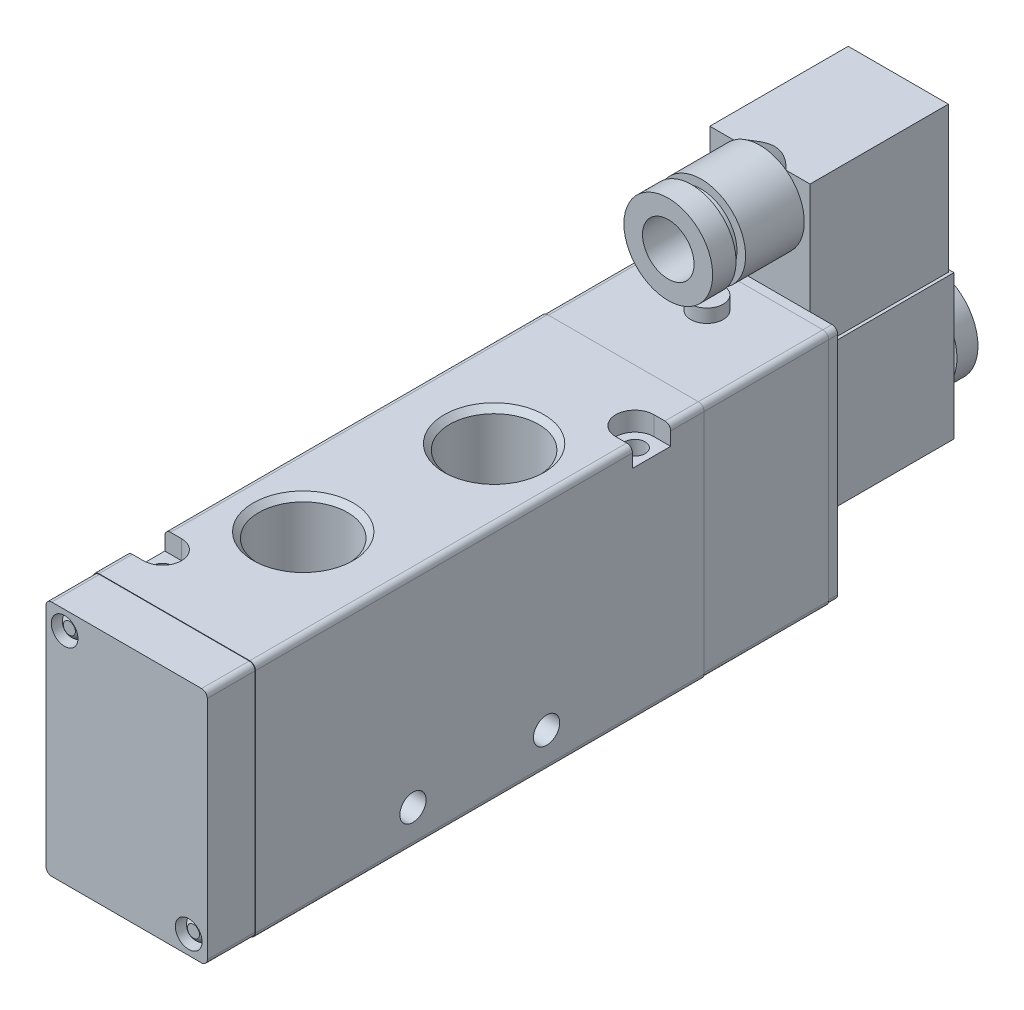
ISO-10303-21;
HEADER;
FILE_DESCRIPTION(('STEP AP214'),'2;1');
FILE_NAME('part.step','',(''),(''),'','','');
FILE_SCHEMA(('AUTOMOTIVE_DESIGN { 1 0 10303 214 1 1 1 1 }'));
ENDSEC;
DATA;
#1=APPLICATION_CONTEXT('core data for automotive mechanical design processes');
#2=APPLICATION_PROTOCOL_DEFINITION('international standard','automotive_design',2000,#1);
#3=PRODUCT_CONTEXT('',#1,'mechanical');
#4=PRODUCT('Part','Part','',(#3));
#5=PRODUCT_RELATED_PRODUCT_CATEGORY('part','',(#4));
#6=PRODUCT_DEFINITION_FORMATION('','',#4);
#7=PRODUCT_DEFINITION_CONTEXT('part definition',#1,'design');
#8=PRODUCT_DEFINITION('design','',#6,#7);
#9=PRODUCT_DEFINITION_SHAPE('','',#8);
#10=(LENGTH_UNIT() NAMED_UNIT(*) SI_UNIT(.MILLI.,.METRE.));
#11=(NAMED_UNIT(*) PLANE_ANGLE_UNIT() SI_UNIT($,.RADIAN.));
#12=(NAMED_UNIT(*) SI_UNIT($,.STERADIAN.) SOLID_ANGLE_UNIT());
#13=UNCERTAINTY_MEASURE_WITH_UNIT(LENGTH_MEASURE(1.E-05),#10,'distance_accuracy_value','');
#14=(GEOMETRIC_REPRESENTATION_CONTEXT(3) GLOBAL_UNCERTAINTY_ASSIGNED_CONTEXT((#13)) GLOBAL_UNIT_ASSIGNED_CONTEXT((#10,
#11,#12)) REPRESENTATION_CONTEXT('',''));
#15=CARTESIAN_POINT('',(0.,0.,0.));
#16=DIRECTION('',(0.,0.,1.));
#17=DIRECTION('',(1.,0.,0.));
#18=AXIS2_PLACEMENT_3D('',#15,#16,#17);
#19=CARTESIAN_POINT('',(0.,47.5,0.));
#20=DIRECTION('',(0.,1.,0.));
#21=DIRECTION('',(0.,0.,1.));
#22=AXIS2_PLACEMENT_3D('',#19,#20,#21);
#23=PLANE('',#22);
#24=DIRECTION('',(1.,0.,0.));
#25=VECTOR('',#24,1.);
#26=CARTESIAN_POINT('',(-10.5,47.5,-122.7));
#27=LINE('',#26,#25);
#28=CARTESIAN_POINT('',(-10.5,47.5,-122.7));
#29=VERTEX_POINT('',#28);
#30=CARTESIAN_POINT('',(-5.49909083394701,47.5,-122.7));
#31=VERTEX_POINT('',#30);
#32=EDGE_CURVE('E373',#29,#31,#27,.T.);
#33=ORIENTED_EDGE('',*,*,#32,.T.);
#34=CARTESIAN_POINT('',(-12.5563156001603,47.5,-113.47561932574));
#35=CARTESIAN_POINT('',(-12.2854300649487,47.5,-113.878349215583));
#36=CARTESIAN_POINT('',(-12.0130171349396,47.5,-114.280062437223));
#37=CARTESIAN_POINT('',(-11.4643400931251,47.5,-115.080938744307));
#38=CARTESIAN_POINT('',(-11.1880753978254,47.5,-115.480101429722));
#39=CARTESIAN_POINT('',(-10.6291432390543,47.5,-116.277859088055));
#40=CARTESIAN_POINT('',(-10.346445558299,47.5,-116.676432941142));
#41=CARTESIAN_POINT('',(-9.77538003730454,47.5,-117.469451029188));
#42=CARTESIAN_POINT('',(-9.4870126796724,47.5,-117.863895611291));
#43=CARTESIAN_POINT('',(-8.87729720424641,47.5,-118.682275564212));
#44=CARTESIAN_POINT('',(-8.55529204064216,47.5,-119.105724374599));
#45=CARTESIAN_POINT('',(-8.0640259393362,47.5,-119.73454951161));
#46=CARTESIAN_POINT('',(-7.89886739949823,47.5,-119.94313237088));
#47=CARTESIAN_POINT('',(-7.56538226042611,47.5,-120.357746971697));
#48=CARTESIAN_POINT('',(-7.39705573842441,47.5,-120.563778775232));
#49=CARTESIAN_POINT('',(-7.05722917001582,47.5,-120.972190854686));
#50=CARTESIAN_POINT('',(-6.88573989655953,47.5,-121.17458007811));
#51=CARTESIAN_POINT('',(-6.53850421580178,47.5,-121.575664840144));
#52=CARTESIAN_POINT('',(-6.36275803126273,47.5,-121.774360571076));
#53=CARTESIAN_POINT('',(-6.0063360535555,47.5,-122.167113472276));
#54=CARTESIAN_POINT('',(-5.82566273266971,47.5,-122.361172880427));
#55=CARTESIAN_POINT('',(-5.45839728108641,47.5,-122.743589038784));
#56=CARTESIAN_POINT('',(-5.27180601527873,47.5,-122.931946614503));
#57=CARTESIAN_POINT('',(-4.98033698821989,47.5,-123.215118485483));
#58=CARTESIAN_POINT('',(-4.87799114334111,47.5,-123.312540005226));
#59=CARTESIAN_POINT('',(-4.67107998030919,47.5,-123.504996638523));
#60=CARTESIAN_POINT('',(-4.56651462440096,47.5,-123.600031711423));
#61=CARTESIAN_POINT('',(-4.24903294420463,47.5,-123.881141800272));
#62=CARTESIAN_POINT('',(-4.03243258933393,47.5,-124.063121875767));
#63=CARTESIAN_POINT('',(-3.58974847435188,47.5,-124.410392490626));
#64=CARTESIAN_POINT('',(-3.3637852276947,47.5,-124.575835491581));
#65=CARTESIAN_POINT('',(-2.89832485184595,47.5,-124.886409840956));
#66=CARTESIAN_POINT('',(-2.65884314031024,47.5,-125.031563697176));
#67=CARTESIAN_POINT('',(-2.28848075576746,47.5,-125.227932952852));
#68=CARTESIAN_POINT('',(-2.16323404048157,47.5,-125.289804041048));
#69=CARTESIAN_POINT('',(-1.90892978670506,47.5,-125.405205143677));
#70=CARTESIAN_POINT('',(-1.77987253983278,47.5,-125.458735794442));
#71=CARTESIAN_POINT('',(-1.5182235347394,47.5,-125.556049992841));
#72=CARTESIAN_POINT('',(-1.38563471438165,47.5,-125.599841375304));
#73=CARTESIAN_POINT('',(-1.11730284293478,47.5,-125.676332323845));
#74=CARTESIAN_POINT('',(-0.981560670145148,47.5,-125.709034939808));
#75=CARTESIAN_POINT('',(-0.705986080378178,47.5,-125.762446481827));
#76=CARTESIAN_POINT('',(-0.566123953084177,47.5,-125.783003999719));
#77=CARTESIAN_POINT('',(-0.285066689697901,47.5,-125.810582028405));
#78=CARTESIAN_POINT('',(-0.143871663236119,47.5,-125.817603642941));
#79=CARTESIAN_POINT('',(0.138470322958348,47.5,-125.817777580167));
#80=CARTESIAN_POINT('',(0.279617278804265,47.5,-125.810935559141));
#81=CARTESIAN_POINT('',(0.560597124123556,47.5,-125.783720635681));
#82=CARTESIAN_POINT('',(0.700429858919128,47.5,-125.763346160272));
#83=CARTESIAN_POINT('',(0.990854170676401,47.5,-125.707420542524));
#84=CARTESIAN_POINT('',(1.14120133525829,47.5,-125.670608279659));
#85=CARTESIAN_POINT('',(1.43795611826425,47.5,-125.583515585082));
#86=CARTESIAN_POINT('',(1.58436203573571,47.5,-125.533229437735));
#87=CARTESIAN_POINT('',(1.87297896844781,47.5,-125.420964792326));
#88=CARTESIAN_POINT('',(2.01517907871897,47.5,-125.358958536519));
#89=CARTESIAN_POINT('',(2.29486633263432,47.5,-125.225178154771));
#90=CARTESIAN_POINT('',(2.43235339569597,47.5,-125.153403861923));
#91=CARTESIAN_POINT('',(2.7225327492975,47.5,-124.990619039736));
#92=CARTESIAN_POINT('',(2.87450445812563,47.5,-124.898330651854));
#93=CARTESIAN_POINT('',(3.17287040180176,47.5,-124.705098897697));
#94=CARTESIAN_POINT('',(3.31926260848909,47.5,-124.604152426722));
#95=CARTESIAN_POINT('',(3.60713919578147,47.5,-124.395124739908));
#96=CARTESIAN_POINT('',(3.7486165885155,47.5,-124.287033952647));
#97=CARTESIAN_POINT('',(4.02700910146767,47.5,-124.065121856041));
#98=CARTESIAN_POINT('',(4.16392366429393,47.5,-123.951299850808));
#99=CARTESIAN_POINT('',(4.43548048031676,47.5,-123.717403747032));
#100=CARTESIAN_POINT('',(4.57006822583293,47.5,-123.597266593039));
#101=CARTESIAN_POINT('',(4.83555082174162,47.5,-123.352985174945));
#102=CARTESIAN_POINT('',(4.96644557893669,47.5,-123.228840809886));
#103=CARTESIAN_POINT('',(5.22484154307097,47.5,-122.977321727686));
#104=CARTESIAN_POINT('',(5.35234588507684,47.5,-122.849950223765));
#105=CARTESIAN_POINT('',(5.60445038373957,47.5,-122.592383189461));
#106=CARTESIAN_POINT('',(5.72905066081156,47.5,-122.462187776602));
#107=CARTESIAN_POINT('',(6.1356620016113,47.5,-122.028953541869));
#108=CARTESIAN_POINT('',(6.41220633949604,47.5,-121.720777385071));
#109=CARTESIAN_POINT('',(6.95490719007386,47.5,-121.095379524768));
#110=CARTESIAN_POINT('',(7.22106139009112,47.5,-120.778155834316));
#111=CARTESIAN_POINT('',(7.7453418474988,47.5,-120.136767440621));
#112=CARTESIAN_POINT('',(8.00346197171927,47.5,-119.812597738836));
#113=CARTESIAN_POINT('',(8.51308347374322,47.5,-119.15915803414));
#114=CARTESIAN_POINT('',(8.76458539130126,47.5,-118.829888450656));
#115=CARTESIAN_POINT('',(9.26309460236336,47.5,-118.16616625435));
#116=CARTESIAN_POINT('',(9.51008305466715,47.5,-117.831699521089));
#117=CARTESIAN_POINT('',(9.9996083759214,47.5,-117.159521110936));
#118=CARTESIAN_POINT('',(10.2421451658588,47.5,-116.82180937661));
#119=CARTESIAN_POINT('',(10.7233981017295,47.5,-116.143893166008));
#120=CARTESIAN_POINT('',(10.9621158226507,47.5,-115.803689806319));
#121=CARTESIAN_POINT('',(11.4364144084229,47.5,-115.1211019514));
#122=CARTESIAN_POINT('',(11.6719952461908,47.5,-114.778717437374));
#123=CARTESIAN_POINT('',(12.318091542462,47.5,-113.831861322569));
#124=CARTESIAN_POINT('',(12.7258225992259,47.5,-113.225489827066));
#125=CARTESIAN_POINT('',(13.5350009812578,47.5,-112.008477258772));
#126=CARTESIAN_POINT('',(13.9364475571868,47.5,-111.397835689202));
#127=CARTESIAN_POINT('',(14.731625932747,47.5,-110.177473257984));
#128=CARTESIAN_POINT('',(15.125391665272,47.5,-109.567774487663));
#129=CARTESIAN_POINT('',(15.7130348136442,47.5,-108.651370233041));
#130=CARTESIAN_POINT('',(15.9083997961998,47.5,-108.345616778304));
#131=CARTESIAN_POINT('',(16.2982305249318,47.5,-107.733538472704));
#132=CARTESIAN_POINT('',(16.4926962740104,47.5,-107.42721362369));
#133=CARTESIAN_POINT('',(16.6867590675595,47.5,-107.120633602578));
#134=B_SPLINE_CURVE_WITH_KNOTS('',3,(#34,#35,#36,#37,#38,#39,#40,#41,#42,#43,#44,#45,#46,#47,
#48,#49,#50,#51,#52,#53,#54,#55,#56,#57,#58,#59,#60,#61,#62,#63,#64,#65,#66,#67,#68,#69,#70,#71,
#72,#73,#74,#75,#76,#77,#78,#79,#80,#81,#82,#83,#84,#85,#86,#87,#88,#89,#90,#91,#92,#93,#94,#95,
#96,#97,#98,#99,#100,#101,#102,#103,#104,#105,#106,#107,#108,#109,#110,#111,#112,#113,#114,#115,
#116,#117,#118,#119,#120,#121,#122,#123,#124,#125,#126,#127,#128,#129,#130,#131,#132,#133),
.UNSPECIFIED.,.F.,.F.,(4,2,2,2,2,2,2,2,2,2,2,2,2,2,2,2,2,2,2,2,2,2,2,2,2,2,2,2,2,2,2,2,2,2,2,2,
2,2,2,2,2,2,2,2,2,2,2,2,2,4),(0.,1.45607721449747,2.91237745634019,4.3782856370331,
5.84406957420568,7.43983326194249,8.23796766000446,9.03608262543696,9.83185346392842,
10.627582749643,11.422919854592,12.2181412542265,12.6420061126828,13.065878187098,
13.9140491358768,14.7534927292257,15.5919975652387,16.0108400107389,16.4296504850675,
16.8481228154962,17.2664799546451,17.6899481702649,18.1133818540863,18.5366428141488,
18.9599529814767,19.4235981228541,19.8874402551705,20.3523950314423,20.8173577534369,
21.3503886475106,21.8836114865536,22.417563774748,22.951581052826,23.4927068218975,
24.0338462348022,24.5744665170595,25.1150643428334,26.3568984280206,27.5990073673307,
28.8420423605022,30.0849756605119,31.3322650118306,32.5795764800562,33.8263595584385,
35.0731533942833,37.2652124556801,39.4575309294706,41.6349072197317,42.7234251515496,
43.8119395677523),.UNSPECIFIED.);
#135=CARTESIAN_POINT('',(5.499090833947,47.5,-122.7));
#136=VERTEX_POINT('',#135);
#137=EDGE_CURVE('E45',#31,#136,#134,.T.);
#138=ORIENTED_EDGE('',*,*,#137,.T.);
#139=CARTESIAN_POINT('',(10.5,47.5,-122.7));
#140=VERTEX_POINT('',#139);
#141=EDGE_CURVE('E376',#136,#140,#27,.T.);
#142=ORIENTED_EDGE('',*,*,#141,.T.);
#143=DIRECTION('',(0.,0.,-1.));
#144=VECTOR('',#143,1.);
#145=CARTESIAN_POINT('',(10.5,47.5,-122.7));
#146=LINE('',#145,#144);
#147=CARTESIAN_POINT('',(10.5,47.5,-151.7));
#148=VERTEX_POINT('',#147);
#149=EDGE_CURVE('E380',#140,#148,#146,.T.);
#150=ORIENTED_EDGE('',*,*,#149,.T.);
#151=DIRECTION('',(-1.,0.,0.));
#152=VECTOR('',#151,1.);
#153=CARTESIAN_POINT('',(10.5,47.5,-151.7));
#154=LINE('',#153,#152);
#155=CARTESIAN_POINT('',(-10.5,47.5,-151.7));
#156=VERTEX_POINT('',#155);
#157=EDGE_CURVE('E382',#148,#156,#154,.T.);
#158=ORIENTED_EDGE('',*,*,#157,.T.);
#159=DIRECTION('',(0.,0.,1.));
#160=VECTOR('',#159,1.);
#161=CARTESIAN_POINT('',(-10.5,47.5,-151.7));
#162=LINE('',#161,#160);
#163=EDGE_CURVE('E378',#156,#29,#162,.T.);
#164=ORIENTED_EDGE('',*,*,#163,.T.);
#165=EDGE_LOOP('',(#33,#138,#142,#150,#158,#164));
#166=FACE_BOUND('',#165,.T.);
#167=ADVANCED_FACE('F37',(#166),#23,.T.);
#168=CARTESIAN_POINT('',(11.15,17.,-152.2));
#169=DIRECTION('',(0.,-1.,0.));
#170=DIRECTION('',(0.,0.,-1.));
#171=AXIS2_PLACEMENT_3D('',#168,#169,#170);
#172=PLANE('',#171);
#173=DIRECTION('',(-1.,0.,0.));
#174=VECTOR('',#173,1.);
#175=CARTESIAN_POINT('',(11.15,17.,-152.2));
#176=LINE('',#175,#174);
#177=CARTESIAN_POINT('',(11.15,17.,-152.2));
#178=VERTEX_POINT('',#177);
#179=CARTESIAN_POINT('',(-11.15,17.,-152.2));
#180=VERTEX_POINT('',#179);
#181=EDGE_CURVE('E435',#178,#180,#176,.T.);
#182=ORIENTED_EDGE('',*,*,#181,.T.);
#183=DIRECTION('',(0.,0.,1.));
#184=VECTOR('',#183,1.);
#185=CARTESIAN_POINT('',(-11.15,17.,-152.2));
#186=LINE('',#185,#184);
#187=CARTESIAN_POINT('',(-11.15,17.,-122.2));
#188=VERTEX_POINT('',#187);
#189=EDGE_CURVE('E414',#180,#188,#186,.T.);
#190=ORIENTED_EDGE('',*,*,#189,.T.);
#191=DIRECTION('',(-1.,0.,0.));
#192=VECTOR('',#191,1.);
#193=CARTESIAN_POINT('',(11.15,17.,-122.2));
#194=LINE('',#193,#192);
#195=CARTESIAN_POINT('',(11.15,17.,-122.2));
#196=VERTEX_POINT('',#195);
#197=EDGE_CURVE('E442',#196,#188,#194,.T.);
#198=ORIENTED_EDGE('',*,*,#197,.F.);
#199=DIRECTION('',(0.,0.,1.));
#200=VECTOR('',#199,1.);
#201=CARTESIAN_POINT('',(11.15,17.,-152.2));
#202=LINE('',#201,#200);
#203=EDGE_CURVE('E425',#178,#196,#202,.T.);
#204=ORIENTED_EDGE('',*,*,#203,.F.);
#205=EDGE_LOOP('',(#182,#190,#198,#204));
#206=FACE_BOUND('',#205,.T.);
#207=DIRECTION('',(0.,0.,1.));
#208=VECTOR('',#207,1.);
#209=CARTESIAN_POINT('',(-10.5,17.,-152.2));
#210=LINE('',#209,#208);
#211=CARTESIAN_POINT('',(-10.5,17.,-151.7));
#212=VERTEX_POINT('',#211);
#213=CARTESIAN_POINT('',(-10.5,17.,-122.7));
#214=VERTEX_POINT('',#213);
#215=EDGE_CURVE('E362',#212,#214,#210,.T.);
#216=ORIENTED_EDGE('',*,*,#215,.F.);
#217=DIRECTION('',(-1.,0.,0.));
#218=VECTOR('',#217,1.);
#219=CARTESIAN_POINT('',(11.15,17.,-151.7));
#220=LINE('',#219,#218);
#221=CARTESIAN_POINT('',(10.5,17.,-151.7));
#222=VERTEX_POINT('',#221);
#223=EDGE_CURVE('E868',#222,#212,#220,.T.);
#224=ORIENTED_EDGE('',*,*,#223,.F.);
#225=DIRECTION('',(0.,0.,-1.));
#226=VECTOR('',#225,1.);
#227=CARTESIAN_POINT('',(10.5,17.,-152.2));
#228=LINE('',#227,#226);
#229=CARTESIAN_POINT('',(10.5,17.,-122.7));
#230=VERTEX_POINT('',#229);
#231=EDGE_CURVE('E871',#230,#222,#228,.T.);
#232=ORIENTED_EDGE('',*,*,#231,.F.);
#233=DIRECTION('',(1.,0.,0.));
#234=VECTOR('',#233,1.);
#235=CARTESIAN_POINT('',(11.15,17.,-122.7));
#236=LINE('',#235,#234);
#237=EDGE_CURVE('E59',#214,#230,#236,.T.);
#238=ORIENTED_EDGE('',*,*,#237,.F.);
#239=EDGE_LOOP('',(#216,#224,#232,#238));
#240=FACE_BOUND('',#239,.T.);
#241=ADVANCED_FACE('F920',(#206,#240),#172,.F.);
#242=CARTESIAN_POINT('',(-15.8,23.8,0.));
#243=DIRECTION('',(0.,0.,1.));
#244=DIRECTION('',(1.,0.,0.));
#245=AXIS2_PLACEMENT_3D('',#242,#243,#244);
#246=PLANE('',#245);
#247=CARTESIAN_POINT('',(-15.8,23.8,0.));
#248=DIRECTION('',(0.,0.,1.));
#249=DIRECTION('',(1.,0.,0.));
#250=AXIS2_PLACEMENT_3D('',#247,#248,#249);
#251=CIRCLE('',#250,1.20000000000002);
#252=CARTESIAN_POINT('',(-15.8,25.,0.));
#253=VERTEX_POINT('',#252);
#254=CARTESIAN_POINT('',(-17.,23.8,0.));
#255=VERTEX_POINT('',#254);
#256=EDGE_CURVE('E765',#253,#255,#251,.T.);
#257=ORIENTED_EDGE('',*,*,#256,.T.);
#258=DIRECTION('',(0.,-1.,0.));
#259=VECTOR('',#258,1.);
#260=CARTESIAN_POINT('',(-17.,23.8,0.));
#261=LINE('',#260,#259);
#262=CARTESIAN_POINT('',(-17.,-23.8,0.));
#263=VERTEX_POINT('',#262);
#264=EDGE_CURVE('E794',#255,#263,#261,.T.);
#265=ORIENTED_EDGE('',*,*,#264,.T.);
#266=CARTESIAN_POINT('',(-15.8,-23.8,0.));
#267=DIRECTION('',(0.,0.,1.));
#268=DIRECTION('',(1.,0.,0.));
#269=AXIS2_PLACEMENT_3D('',#266,#267,#268);
#270=CIRCLE('',#269,1.20000000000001);
#271=CARTESIAN_POINT('',(-15.8,-25.,0.));
#272=VERTEX_POINT('',#271);
#273=EDGE_CURVE('E797',#263,#272,#270,.T.);
#274=ORIENTED_EDGE('',*,*,#273,.T.);
#275=DIRECTION('',(1.,0.,0.));
#276=VECTOR('',#275,1.);
#277=CARTESIAN_POINT('',(-15.8,-25.,0.));
#278=LINE('',#277,#276);
#279=CARTESIAN_POINT('',(15.8,-25.,0.));
#280=VERTEX_POINT('',#279);
#281=EDGE_CURVE('E800',#272,#280,#278,.T.);
#282=ORIENTED_EDGE('',*,*,#281,.T.);
#283=CARTESIAN_POINT('',(15.8,-23.8,0.));
#284=DIRECTION('',(0.,0.,1.));
#285=DIRECTION('',(1.,0.,0.));
#286=AXIS2_PLACEMENT_3D('',#283,#284,#285);
#287=CIRCLE('',#286,1.20000000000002);
#288=CARTESIAN_POINT('',(17.,-23.8,0.));
#289=VERTEX_POINT('',#288);
#290=EDGE_CURVE('E803',#280,#289,#287,.T.);
#291=ORIENTED_EDGE('',*,*,#290,.T.);
#292=DIRECTION('',(0.,1.,0.));
#293=VECTOR('',#292,1.);
#294=CARTESIAN_POINT('',(17.,-23.8,0.));
#295=LINE('',#294,#293);
#296=CARTESIAN_POINT('',(17.,23.8,0.));
#297=VERTEX_POINT('',#296);
#298=EDGE_CURVE('E806',#289,#297,#295,.T.);
#299=ORIENTED_EDGE('',*,*,#298,.T.);
#300=CARTESIAN_POINT('',(15.8,23.8,0.));
#301=DIRECTION('',(0.,0.,1.));
#302=DIRECTION('',(1.,0.,0.));
#303=AXIS2_PLACEMENT_3D('',#300,#301,#302);
#304=CIRCLE('',#303,1.20000000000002);
#305=CARTESIAN_POINT('',(15.8,25.,0.));
#306=VERTEX_POINT('',#305);
#307=EDGE_CURVE('E809',#297,#306,#304,.T.);
#308=ORIENTED_EDGE('',*,*,#307,.T.);
#309=DIRECTION('',(-1.,0.,0.));
#310=VECTOR('',#309,1.);
#311=CARTESIAN_POINT('',(15.8,25.,0.));
#312=LINE('',#311,#310);
#313=EDGE_CURVE('E770',#306,#253,#312,.T.);
#314=ORIENTED_EDGE('',*,*,#313,.T.);
#315=EDGE_LOOP('',(#257,#265,#274,#282,#291,#299,#308,#314));
#316=FACE_BOUND('',#315,.T.);
#317=DIRECTION('',(0.,-1.,0.));
#318=VECTOR('',#317,1.);
#319=CARTESIAN_POINT('',(-16.9,23.7,0.));
#320=LINE('',#319,#318);
#321=CARTESIAN_POINT('',(-16.9,23.7,0.));
#322=VERTEX_POINT('',#321);
#323=CARTESIAN_POINT('',(-16.9,-23.7,0.));
#324=VERTEX_POINT('',#323);
#325=EDGE_CURVE('E602',#322,#324,#320,.T.);
#326=ORIENTED_EDGE('',*,*,#325,.F.);
#327=CARTESIAN_POINT('',(-15.7,23.7,0.));
#328=DIRECTION('',(0.,0.,1.));
#329=DIRECTION('',(1.,0.,0.));
#330=AXIS2_PLACEMENT_3D('',#327,#328,#329);
#331=CIRCLE('',#330,1.20000000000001);
#332=CARTESIAN_POINT('',(-15.7,24.9,0.));
#333=VERTEX_POINT('',#332);
#334=EDGE_CURVE('E580',#333,#322,#331,.T.);
#335=ORIENTED_EDGE('',*,*,#334,.F.);
#336=DIRECTION('',(-1.,0.,0.));
#337=VECTOR('',#336,1.);
#338=CARTESIAN_POINT('',(15.7,24.9,0.));
#339=LINE('',#338,#337);
#340=CARTESIAN_POINT('',(15.7,24.9,0.));
#341=VERTEX_POINT('',#340);
#342=EDGE_CURVE('E585',#341,#333,#339,.T.);
#343=ORIENTED_EDGE('',*,*,#342,.F.);
#344=CARTESIAN_POINT('',(15.7,23.7,0.));
#345=DIRECTION('',(0.,0.,1.));
#346=DIRECTION('',(1.,0.,0.));
#347=AXIS2_PLACEMENT_3D('',#344,#345,#346);
#348=CIRCLE('',#347,1.2);
#349=CARTESIAN_POINT('',(16.9,23.7,0.));
#350=VERTEX_POINT('',#349);
#351=EDGE_CURVE('E612',#350,#341,#348,.T.);
#352=ORIENTED_EDGE('',*,*,#351,.F.);
#353=DIRECTION('',(0.,1.,0.));
#354=VECTOR('',#353,1.);
#355=CARTESIAN_POINT('',(16.9,-23.7,0.));
#356=LINE('',#355,#354);
#357=CARTESIAN_POINT('',(16.9,-23.7,0.));
#358=VERTEX_POINT('',#357);
#359=EDGE_CURVE('E610',#358,#350,#356,.T.);
#360=ORIENTED_EDGE('',*,*,#359,.F.);
#361=CARTESIAN_POINT('',(15.7,-23.7,0.));
#362=DIRECTION('',(0.,0.,1.));
#363=DIRECTION('',(1.,0.,0.));
#364=AXIS2_PLACEMENT_3D('',#361,#362,#363);
#365=CIRCLE('',#364,1.2);
#366=CARTESIAN_POINT('',(15.7,-24.9,0.));
#367=VERTEX_POINT('',#366);
#368=EDGE_CURVE('E608',#367,#358,#365,.T.);
#369=ORIENTED_EDGE('',*,*,#368,.F.);
#370=DIRECTION('',(1.,0.,0.));
#371=VECTOR('',#370,1.);
#372=CARTESIAN_POINT('',(-15.7,-24.9,0.));
#373=LINE('',#372,#371);
#374=CARTESIAN_POINT('',(-15.7,-24.9,0.));
#375=VERTEX_POINT('',#374);
#376=EDGE_CURVE('E606',#375,#367,#373,.T.);
#377=ORIENTED_EDGE('',*,*,#376,.F.);
#378=CARTESIAN_POINT('',(-15.7,-23.7,0.));
#379=DIRECTION('',(0.,0.,1.));
#380=DIRECTION('',(1.,0.,0.));
#381=AXIS2_PLACEMENT_3D('',#378,#379,#380);
#382=CIRCLE('',#381,1.20000000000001);
#383=EDGE_CURVE('E604',#324,#375,#382,.T.);
#384=ORIENTED_EDGE('',*,*,#383,.F.);
#385=EDGE_LOOP('',(#326,#335,#343,#352,#360,#369,#377,#384));
#386=FACE_BOUND('',#385,.T.);
#387=ADVANCED_FACE('F924',(#316,#386),#246,.T.);
#388=CARTESIAN_POINT('',(15.8,23.8,-94.));
#389=DIRECTION('',(0.,0.,1.));
#390=DIRECTION('',(1.,0.,0.));
#391=AXIS2_PLACEMENT_3D('',#388,#389,#390);
#392=CYLINDRICAL_SURFACE('',#391,1.20000000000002);
#393=CARTESIAN_POINT('',(15.8,23.8,-87.));
#394=DIRECTION('',(0.,0.,-1.));
#395=DIRECTION('',(-1.,0.,0.));
#396=AXIS2_PLACEMENT_3D('',#393,#394,#395);
#397=CIRCLE('',#396,1.20000000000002);
#398=CARTESIAN_POINT('',(17.,23.8,-87.));
#399=VERTEX_POINT('',#398);
#400=CARTESIAN_POINT('',(15.8,25.,-87.));
#401=VERTEX_POINT('',#400);
#402=EDGE_CURVE('E724',#399,#401,#397,.F.);
#403=ORIENTED_EDGE('',*,*,#402,.F.);
#404=DIRECTION('',(0.,0.,1.));
#405=VECTOR('',#404,1.);
#406=CARTESIAN_POINT('',(17.,23.8,-94.));
#407=LINE('',#406,#405);
#408=CARTESIAN_POINT('',(17.,23.8,-94.));
#409=VERTEX_POINT('',#408);
#410=EDGE_CURVE('E823',#409,#399,#407,.T.);
#411=ORIENTED_EDGE('',*,*,#410,.F.);
#412=CARTESIAN_POINT('',(15.8,23.8,-94.));
#413=DIRECTION('',(0.,0.,1.));
#414=DIRECTION('',(1.,0.,0.));
#415=AXIS2_PLACEMENT_3D('',#412,#413,#414);
#416=CIRCLE('',#415,1.20000000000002);
#417=CARTESIAN_POINT('',(15.8,25.,-94.));
#418=VERTEX_POINT('',#417);
#419=EDGE_CURVE('E785',#409,#418,#416,.T.);
#420=ORIENTED_EDGE('',*,*,#419,.T.);
#421=DIRECTION('',(0.,0.,1.));
#422=VECTOR('',#421,1.);
#423=CARTESIAN_POINT('',(15.8,25.,-94.));
#424=LINE('',#423,#422);
#425=EDGE_CURVE('E819',#418,#401,#424,.T.);
#426=ORIENTED_EDGE('',*,*,#425,.T.);
#427=EDGE_LOOP('',(#403,#411,#420,#426));
#428=FACE_BOUND('',#427,.T.);
#429=ADVANCED_FACE('F930',(#428),#392,.T.);
#430=CARTESIAN_POINT('',(13.5,-25.,-83.));
#431=DIRECTION('',(0.,1.,0.));
#432=DIRECTION('',(0.,0.,1.));
#433=AXIS2_PLACEMENT_3D('',#430,#431,#432);
#434=CYLINDRICAL_SURFACE('',#433,2.15);
#435=CARTESIAN_POINT('',(13.5,-25.,-83.));
#436=DIRECTION('',(0.,1.,0.));
#437=DIRECTION('',(0.,0.,1.));
#438=AXIS2_PLACEMENT_3D('',#435,#436,#437);
#439=CIRCLE('',#438,2.15);
#440=CARTESIAN_POINT('',(13.5,-25.,-80.85));
#441=VERTEX_POINT('',#440);
#442=EDGE_CURVE('E759',#441,#441,#439,.T.);
#443=ORIENTED_EDGE('',*,*,#442,.F.);
#444=EDGE_LOOP('',(#443));
#445=FACE_BOUND('',#444,.T.);
#446=CARTESIAN_POINT('',(13.5,21.,-83.));
#447=DIRECTION('',(0.,1.,0.));
#448=DIRECTION('',(0.,0.,1.));
#449=AXIS2_PLACEMENT_3D('',#446,#447,#448);
#450=CIRCLE('',#449,2.15);
#451=CARTESIAN_POINT('',(13.5,21.,-80.85));
#452=VERTEX_POINT('',#451);
#453=EDGE_CURVE('E715',#452,#452,#450,.F.);
#454=ORIENTED_EDGE('',*,*,#453,.F.);
#455=EDGE_LOOP('',(#454));
#456=FACE_BOUND('',#455,.T.);
#457=ADVANCED_FACE('F1178',(#445,#456),#434,.F.);
#458=CARTESIAN_POINT('',(-15.8,23.8,-94.));
#459=DIRECTION('',(0.,0.,1.));
#460=DIRECTION('',(1.,0.,0.));
#461=AXIS2_PLACEMENT_3D('',#458,#459,#460);
#462=CYLINDRICAL_SURFACE('',#461,1.20000000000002);
#463=CARTESIAN_POINT('',(-15.8,23.8,-15.));
#464=DIRECTION('',(0.,0.,-1.));
#465=DIRECTION('',(-1.,0.,0.));
#466=AXIS2_PLACEMENT_3D('',#463,#464,#465);
#467=CIRCLE('',#466,1.20000000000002);
#468=CARTESIAN_POINT('',(-15.8,25.,-15.));
#469=VERTEX_POINT('',#468);
#470=CARTESIAN_POINT('',(-17.,23.8,-15.));
#471=VERTEX_POINT('',#470);
#472=EDGE_CURVE('E757',#469,#471,#467,.F.);
#473=ORIENTED_EDGE('',*,*,#472,.F.);
#474=DIRECTION('',(0.,0.,1.));
#475=VECTOR('',#474,1.);
#476=CARTESIAN_POINT('',(-15.8,25.,-94.));
#477=LINE('',#476,#475);
#478=CARTESIAN_POINT('',(-15.8,25.,-94.));
#479=VERTEX_POINT('',#478);
#480=EDGE_CURVE('E814',#479,#469,#477,.T.);
#481=ORIENTED_EDGE('',*,*,#480,.F.);
#482=CARTESIAN_POINT('',(-15.8,23.8,-94.));
#483=DIRECTION('',(0.,0.,1.));
#484=DIRECTION('',(1.,0.,0.));
#485=AXIS2_PLACEMENT_3D('',#482,#483,#484);
#486=CIRCLE('',#485,1.20000000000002);
#487=CARTESIAN_POINT('',(-17.,23.8,-94.));
#488=VERTEX_POINT('',#487);
#489=EDGE_CURVE('E766',#479,#488,#486,.T.);
#490=ORIENTED_EDGE('',*,*,#489,.T.);
#491=DIRECTION('',(0.,0.,1.));
#492=VECTOR('',#491,1.);
#493=CARTESIAN_POINT('',(-17.,23.8,-94.));
#494=LINE('',#493,#492);
#495=EDGE_CURVE('E835',#488,#471,#494,.T.);
#496=ORIENTED_EDGE('',*,*,#495,.T.);
#497=EDGE_LOOP('',(#473,#481,#490,#496));
#498=FACE_BOUND('',#497,.T.);
#499=ADVANCED_FACE('F1181',(#498),#462,.T.);
#500=CARTESIAN_POINT('',(-13.5,-25.,-11.));
#501=DIRECTION('',(0.,1.,0.));
#502=DIRECTION('',(0.,0.,1.));
#503=AXIS2_PLACEMENT_3D('',#500,#501,#502);
#504=CYLINDRICAL_SURFACE('',#503,2.15);
#505=CARTESIAN_POINT('',(-13.5,-25.,-11.));
#506=DIRECTION('',(0.,1.,0.));
#507=DIRECTION('',(0.,0.,1.));
#508=AXIS2_PLACEMENT_3D('',#505,#506,#507);
#509=CIRCLE('',#508,2.15);
#510=CARTESIAN_POINT('',(-13.5,-25.,-8.85));
#511=VERTEX_POINT('',#510);
#512=EDGE_CURVE('E762',#511,#511,#509,.T.);
#513=ORIENTED_EDGE('',*,*,#512,.F.);
#514=EDGE_LOOP('',(#513));
#515=FACE_BOUND('',#514,.T.);
#516=CARTESIAN_POINT('',(-13.5,21.,-11.));
#517=DIRECTION('',(0.,1.,0.));
#518=DIRECTION('',(0.,0.,1.));
#519=AXIS2_PLACEMENT_3D('',#516,#517,#518);
#520=CIRCLE('',#519,2.15);
#521=CARTESIAN_POINT('',(-13.5,21.,-8.85));
#522=VERTEX_POINT('',#521);
#523=EDGE_CURVE('E747',#522,#522,#520,.F.);
#524=ORIENTED_EDGE('',*,*,#523,.F.);
#525=EDGE_LOOP('',(#524));
#526=FACE_BOUND('',#525,.T.);
#527=ADVANCED_FACE('F1183',(#515,#526),#504,.F.);
#528=CARTESIAN_POINT('',(-15.8,23.8,-6.99999999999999));
#529=DIRECTION('',(0.,0.,1.));
#530=DIRECTION('',(1.,0.,0.));
#531=AXIS2_PLACEMENT_3D('',#528,#529,#530);
#532=CIRCLE('',#531,1.20000000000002);
#533=CARTESIAN_POINT('',(-17.,23.8,-6.99999999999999));
#534=VERTEX_POINT('',#533);
#535=CARTESIAN_POINT('',(-15.8,25.,-6.99999999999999));
#536=VERTEX_POINT('',#535);
#537=EDGE_CURVE('E755',#534,#536,#532,.F.);
#538=ORIENTED_EDGE('',*,*,#537,.F.);
#539=EDGE_CURVE('E791',#534,#255,#494,.T.);
#540=ORIENTED_EDGE('',*,*,#539,.T.);
#541=ORIENTED_EDGE('',*,*,#256,.F.);
#542=EDGE_CURVE('E818',#536,#253,#477,.T.);
#543=ORIENTED_EDGE('',*,*,#542,.F.);
#544=EDGE_LOOP('',(#538,#540,#541,#543));
#545=FACE_BOUND('',#544,.T.);
#546=ADVANCED_FACE('F39',(#545),#462,.T.);
#547=CARTESIAN_POINT('',(15.8,25.,-94.));
#548=DIRECTION('',(0.,1.,0.));
#549=DIRECTION('',(0.,0.,1.));
#550=AXIS2_PLACEMENT_3D('',#547,#548,#549);
#551=PLANE('',#550);
#552=CARTESIAN_POINT('',(2.,25.,-65.));
#553=DIRECTION('',(0.,1.,0.));
#554=DIRECTION('',(0.,0.,1.));
#555=AXIS2_PLACEMENT_3D('',#552,#553,#554);
#556=CIRCLE('',#555,10.4775);
#557=CARTESIAN_POINT('',(2.,25.,-54.5225));
#558=VERTEX_POINT('',#557);
#559=EDGE_CURVE('E682',#558,#558,#556,.T.);
#560=ORIENTED_EDGE('',*,*,#559,.F.);
#561=EDGE_LOOP('',(#560));
#562=FACE_BOUND('',#561,.T.);
#563=CARTESIAN_POINT('',(-2.,25.,-29.));
#564=DIRECTION('',(0.,-1.,0.));
#565=DIRECTION('',(0.,0.,-1.));
#566=AXIS2_PLACEMENT_3D('',#563,#564,#565);
#567=CIRCLE('',#566,10.4775);
#568=CARTESIAN_POINT('',(-2.,25.,-39.4775));
#569=VERTEX_POINT('',#568);
#570=EDGE_CURVE('E685',#569,#569,#567,.T.);
#571=ORIENTED_EDGE('',*,*,#570,.T.);
#572=EDGE_LOOP('',(#571));
#573=FACE_BOUND('',#572,.T.);
#574=DIRECTION('',(-1.,0.,0.));
#575=VECTOR('',#574,1.);
#576=CARTESIAN_POINT('',(17.,25.,-87.));
#577=LINE('',#576,#575);
#578=CARTESIAN_POINT('',(13.5,25.,-87.));
#579=VERTEX_POINT('',#578);
#580=EDGE_CURVE('E699',#401,#579,#577,.T.);
#581=ORIENTED_EDGE('',*,*,#580,.F.);
#582=ORIENTED_EDGE('',*,*,#425,.F.);
#583=DIRECTION('',(-1.,0.,0.));
#584=VECTOR('',#583,1.);
#585=CARTESIAN_POINT('',(15.8,25.,-94.));
#586=LINE('',#585,#584);
#587=EDGE_CURVE('E788',#418,#479,#586,.T.);
#588=ORIENTED_EDGE('',*,*,#587,.T.);
#589=ORIENTED_EDGE('',*,*,#480,.T.);
#590=DIRECTION('',(-1.,0.,0.));
#591=VECTOR('',#590,1.);
#592=CARTESIAN_POINT('',(-13.5,25.,-15.));
#593=LINE('',#592,#591);
#594=CARTESIAN_POINT('',(-13.5,25.,-15.));
#595=VERTEX_POINT('',#594);
#596=EDGE_CURVE('E726',#595,#469,#593,.T.);
#597=ORIENTED_EDGE('',*,*,#596,.F.);
#598=CARTESIAN_POINT('',(-13.5,25.,-11.));
#599=DIRECTION('',(0.,1.,0.));
#600=DIRECTION('',(0.,0.,1.));
#601=AXIS2_PLACEMENT_3D('',#598,#599,#600);
#602=CIRCLE('',#601,4.);
#603=CARTESIAN_POINT('',(-13.5,25.,-6.99999999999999));
#604=VERTEX_POINT('',#603);
#605=EDGE_CURVE('E730',#604,#595,#602,.T.);
#606=ORIENTED_EDGE('',*,*,#605,.F.);
#607=DIRECTION('',(1.,0.,0.));
#608=VECTOR('',#607,1.);
#609=CARTESIAN_POINT('',(-17.,25.,-6.99999999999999));
#610=LINE('',#609,#608);
#611=EDGE_CURVE('E741',#536,#604,#610,.T.);
#612=ORIENTED_EDGE('',*,*,#611,.F.);
#613=ORIENTED_EDGE('',*,*,#542,.T.);
#614=ORIENTED_EDGE('',*,*,#313,.F.);
#615=CARTESIAN_POINT('',(15.8,25.,-79.));
#616=VERTEX_POINT('',#615);
#617=EDGE_CURVE('E822',#616,#306,#424,.T.);
#618=ORIENTED_EDGE('',*,*,#617,.F.);
#619=DIRECTION('',(1.,0.,0.));
#620=VECTOR('',#619,1.);
#621=CARTESIAN_POINT('',(13.5,25.,-79.));
#622=LINE('',#621,#620);
#623=CARTESIAN_POINT('',(13.5,25.,-79.));
#624=VERTEX_POINT('',#623);
#625=EDGE_CURVE('E709',#624,#616,#622,.T.);
#626=ORIENTED_EDGE('',*,*,#625,.F.);
#627=CARTESIAN_POINT('',(13.5,25.,-83.));
#628=DIRECTION('',(0.,1.,0.));
#629=DIRECTION('',(0.,0.,1.));
#630=AXIS2_PLACEMENT_3D('',#627,#628,#629);
#631=CIRCLE('',#630,4.);
#632=EDGE_CURVE('E694',#579,#624,#631,.T.);
#633=ORIENTED_EDGE('',*,*,#632,.F.);
#634=EDGE_LOOP('',(#581,#582,#588,#589,#597,#606,#612,#613,#614,#618,#626,#633));
#635=FACE_BOUND('',#634,.T.);
#636=ADVANCED_FACE('F1191',(#562,#573,#635),#551,.T.);
#637=CARTESIAN_POINT('',(15.8,23.8,-79.));
#638=DIRECTION('',(0.,0.,1.));
#639=DIRECTION('',(1.,0.,0.));
#640=AXIS2_PLACEMENT_3D('',#637,#638,#639);
#641=CIRCLE('',#640,1.20000000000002);
#642=CARTESIAN_POINT('',(17.,23.8,-79.));
#643=VERTEX_POINT('',#642);
#644=EDGE_CURVE('E722',#616,#643,#641,.F.);
#645=ORIENTED_EDGE('',*,*,#644,.F.);
#646=ORIENTED_EDGE('',*,*,#617,.T.);
#647=ORIENTED_EDGE('',*,*,#307,.F.);
#648=EDGE_CURVE('E826',#643,#297,#407,.T.);
#649=ORIENTED_EDGE('',*,*,#648,.F.);
#650=EDGE_LOOP('',(#645,#646,#647,#649));
#651=FACE_BOUND('',#650,.T.);
#652=ADVANCED_FACE('F1194',(#651),#392,.T.);
#653=CARTESIAN_POINT('',(17.,-23.8,-94.));
#654=DIRECTION('',(1.,0.,0.));
#655=DIRECTION('',(0.,0.,-1.));
#656=AXIS2_PLACEMENT_3D('',#653,#654,#655);
#657=PLANE('',#656);
#658=CARTESIAN_POINT('',(17.,-17.5,-61.));
#659=DIRECTION('',(1.,0.,0.));
#660=DIRECTION('',(0.,0.,-1.));
#661=AXIS2_PLACEMENT_3D('',#658,#659,#660);
#662=CIRCLE('',#661,2.75);
#663=CARTESIAN_POINT('',(17.,-17.5,-63.75));
#664=VERTEX_POINT('',#663);
#665=EDGE_CURVE('E664',#664,#664,#662,.T.);
#666=ORIENTED_EDGE('',*,*,#665,.F.);
#667=EDGE_LOOP('',(#666));
#668=FACE_BOUND('',#667,.T.);
#669=CARTESIAN_POINT('',(17.,-17.5,-33.));
#670=DIRECTION('',(1.,0.,0.));
#671=DIRECTION('',(0.,0.,-1.));
#672=AXIS2_PLACEMENT_3D('',#669,#670,#671);
#673=CIRCLE('',#672,2.75);
#674=CARTESIAN_POINT('',(17.,-17.5,-35.75));
#675=VERTEX_POINT('',#674);
#676=EDGE_CURVE('E670',#675,#675,#673,.T.);
#677=ORIENTED_EDGE('',*,*,#676,.F.);
#678=EDGE_LOOP('',(#677));
#679=FACE_BOUND('',#678,.T.);
#680=DIRECTION('',(0.,1.,0.));
#681=VECTOR('',#680,1.);
#682=CARTESIAN_POINT('',(17.,21.,-87.));
#683=LINE('',#682,#681);
#684=CARTESIAN_POINT('',(17.,21.,-87.));
#685=VERTEX_POINT('',#684);
#686=EDGE_CURVE('E716',#685,#399,#683,.T.);
#687=ORIENTED_EDGE('',*,*,#686,.F.);
#688=DIRECTION('',(0.,0.,-1.));
#689=VECTOR('',#688,1.);
#690=CARTESIAN_POINT('',(17.,21.,-79.));
#691=LINE('',#690,#689);
#692=CARTESIAN_POINT('',(17.,21.,-79.));
#693=VERTEX_POINT('',#692);
#694=EDGE_CURVE('E701',#693,#685,#691,.T.);
#695=ORIENTED_EDGE('',*,*,#694,.F.);
#696=DIRECTION('',(0.,1.,0.));
#697=VECTOR('',#696,1.);
#698=CARTESIAN_POINT('',(17.,21.,-79.));
#699=LINE('',#698,#697);
#700=EDGE_CURVE('E718',#693,#643,#699,.T.);
#701=ORIENTED_EDGE('',*,*,#700,.T.);
#702=ORIENTED_EDGE('',*,*,#648,.T.);
#703=ORIENTED_EDGE('',*,*,#298,.F.);
#704=DIRECTION('',(0.,0.,1.));
#705=VECTOR('',#704,1.);
#706=CARTESIAN_POINT('',(17.,-23.8,-94.));
#707=LINE('',#706,#705);
#708=CARTESIAN_POINT('',(17.,-23.8,-94.));
#709=VERTEX_POINT('',#708);
#710=EDGE_CURVE('E827',#709,#289,#707,.T.);
#711=ORIENTED_EDGE('',*,*,#710,.F.);
#712=DIRECTION('',(0.,1.,0.));
#713=VECTOR('',#712,1.);
#714=CARTESIAN_POINT('',(17.,-23.8,-94.));
#715=LINE('',#714,#713);
#716=EDGE_CURVE('E782',#709,#409,#715,.T.);
#717=ORIENTED_EDGE('',*,*,#716,.T.);
#718=ORIENTED_EDGE('',*,*,#410,.T.);
#719=EDGE_LOOP('',(#687,#695,#701,#702,#703,#711,#717,#718));
#720=FACE_BOUND('',#719,.T.);
#721=ADVANCED_FACE('F1198',(#668,#679,#720),#657,.T.);
#722=CARTESIAN_POINT('',(15.8,-23.8,-94.));
#723=DIRECTION('',(0.,0.,1.));
#724=DIRECTION('',(1.,0.,0.));
#725=AXIS2_PLACEMENT_3D('',#722,#723,#724);
#726=CYLINDRICAL_SURFACE('',#725,1.20000000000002);
#727=ORIENTED_EDGE('',*,*,#290,.F.);
#728=DIRECTION('',(0.,0.,1.));
#729=VECTOR('',#728,1.);
#730=CARTESIAN_POINT('',(15.8,-25.,-94.));
#731=LINE('',#730,#729);
#732=CARTESIAN_POINT('',(15.8,-25.,-94.));
#733=VERTEX_POINT('',#732);
#734=EDGE_CURVE('E829',#733,#280,#731,.T.);
#735=ORIENTED_EDGE('',*,*,#734,.F.);
#736=CARTESIAN_POINT('',(15.8,-23.8,-94.));
#737=DIRECTION('',(0.,0.,1.));
#738=DIRECTION('',(1.,0.,0.));
#739=AXIS2_PLACEMENT_3D('',#736,#737,#738);
#740=CIRCLE('',#739,1.20000000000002);
#741=EDGE_CURVE('E779',#733,#709,#740,.T.);
#742=ORIENTED_EDGE('',*,*,#741,.T.);
#743=ORIENTED_EDGE('',*,*,#710,.T.);
#744=EDGE_LOOP('',(#727,#735,#742,#743));
#745=FACE_BOUND('',#744,.T.);
#746=ADVANCED_FACE('F1202',(#745),#726,.T.);
#747=CARTESIAN_POINT('',(-15.8,-25.,-94.));
#748=DIRECTION('',(0.,-1.,0.));
#749=DIRECTION('',(0.,0.,-1.));
#750=AXIS2_PLACEMENT_3D('',#747,#748,#749);
#751=PLANE('',#750);
#752=CARTESIAN_POINT('',(0.,-25.,-78.5));
#753=DIRECTION('',(0.,-1.,0.));
#754=DIRECTION('',(0.,0.,-1.));
#755=AXIS2_PLACEMENT_3D('',#752,#753,#754);
#756=CIRCLE('',#755,10.4775);
#757=CARTESIAN_POINT('',(0.,-25.,-88.9775));
#758=VERTEX_POINT('',#757);
#759=EDGE_CURVE('E643',#758,#758,#756,.T.);
#760=ORIENTED_EDGE('',*,*,#759,.F.);
#761=EDGE_LOOP('',(#760));
#762=FACE_BOUND('',#761,.T.);
#763=CARTESIAN_POINT('',(0.,-25.,-47.));
#764=DIRECTION('',(0.,-1.,0.));
#765=DIRECTION('',(0.,0.,-1.));
#766=AXIS2_PLACEMENT_3D('',#763,#764,#765);
#767=CIRCLE('',#766,10.4775);
#768=CARTESIAN_POINT('',(0.,-25.,-57.4775));
#769=VERTEX_POINT('',#768);
#770=EDGE_CURVE('E652',#769,#769,#767,.T.);
#771=ORIENTED_EDGE('',*,*,#770,.F.);
#772=EDGE_LOOP('',(#771));
#773=FACE_BOUND('',#772,.T.);
#774=CARTESIAN_POINT('',(0.,-25.,-15.5));
#775=DIRECTION('',(0.,1.,0.));
#776=DIRECTION('',(0.,0.,1.));
#777=AXIS2_PLACEMENT_3D('',#774,#775,#776);
#778=CIRCLE('',#777,10.4775);
#779=CARTESIAN_POINT('',(0.,-25.,-5.0225));
#780=VERTEX_POINT('',#779);
#781=EDGE_CURVE('E655',#780,#780,#778,.T.);
#782=ORIENTED_EDGE('',*,*,#781,.T.);
#783=EDGE_LOOP('',(#782));
#784=FACE_BOUND('',#783,.T.);
#785=ORIENTED_EDGE('',*,*,#442,.T.);
#786=EDGE_LOOP('',(#785));
#787=FACE_BOUND('',#786,.T.);
#788=ORIENTED_EDGE('',*,*,#512,.T.);
#789=EDGE_LOOP('',(#788));
#790=FACE_BOUND('',#789,.T.);
#791=ORIENTED_EDGE('',*,*,#281,.F.);
#792=DIRECTION('',(0.,0.,1.));
#793=VECTOR('',#792,1.);
#794=CARTESIAN_POINT('',(-15.8,-25.,-94.));
#795=LINE('',#794,#793);
#796=CARTESIAN_POINT('',(-15.8,-25.,-94.));
#797=VERTEX_POINT('',#796);
#798=EDGE_CURVE('E831',#797,#272,#795,.T.);
#799=ORIENTED_EDGE('',*,*,#798,.F.);
#800=DIRECTION('',(1.,0.,0.));
#801=VECTOR('',#800,1.);
#802=CARTESIAN_POINT('',(-15.8,-25.,-94.));
#803=LINE('',#802,#801);
#804=EDGE_CURVE('E776',#797,#733,#803,.T.);
#805=ORIENTED_EDGE('',*,*,#804,.T.);
#806=ORIENTED_EDGE('',*,*,#734,.T.);
#807=EDGE_LOOP('',(#791,#799,#805,#806));
#808=FACE_BOUND('',#807,.T.);
#809=ADVANCED_FACE('F1206',(#762,#773,#784,#787,#790,#808),#751,.T.);
#810=CARTESIAN_POINT('',(-15.8,-23.8,-94.));
#811=DIRECTION('',(0.,0.,1.));
#812=DIRECTION('',(1.,0.,0.));
#813=AXIS2_PLACEMENT_3D('',#810,#811,#812);
#814=CYLINDRICAL_SURFACE('',#813,1.20000000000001);
#815=ORIENTED_EDGE('',*,*,#273,.F.);
#816=DIRECTION('',(0.,0.,1.));
#817=VECTOR('',#816,1.);
#818=CARTESIAN_POINT('',(-17.,-23.8,-94.));
#819=LINE('',#818,#817);
#820=CARTESIAN_POINT('',(-17.,-23.8,-94.));
#821=VERTEX_POINT('',#820);
#822=EDGE_CURVE('E833',#821,#263,#819,.T.);
#823=ORIENTED_EDGE('',*,*,#822,.F.);
#824=CARTESIAN_POINT('',(-15.8,-23.8,-94.));
#825=DIRECTION('',(0.,0.,1.));
#826=DIRECTION('',(1.,0.,0.));
#827=AXIS2_PLACEMENT_3D('',#824,#825,#826);
#828=CIRCLE('',#827,1.20000000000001);
#829=EDGE_CURVE('E773',#821,#797,#828,.T.);
#830=ORIENTED_EDGE('',*,*,#829,.T.);
#831=ORIENTED_EDGE('',*,*,#798,.T.);
#832=EDGE_LOOP('',(#815,#823,#830,#831));
#833=FACE_BOUND('',#832,.T.);
#834=ADVANCED_FACE('F1210',(#833),#814,.T.);
#835=CARTESIAN_POINT('',(-17.,23.8,-94.));
#836=DIRECTION('',(-1.,0.,0.));
#837=DIRECTION('',(0.,0.,1.));
#838=AXIS2_PLACEMENT_3D('',#835,#836,#837);
#839=PLANE('',#838);
#840=CARTESIAN_POINT('',(-17.,-17.5,-61.));
#841=DIRECTION('',(1.,0.,0.));
#842=DIRECTION('',(0.,0.,-1.));
#843=AXIS2_PLACEMENT_3D('',#840,#841,#842);
#844=CIRCLE('',#843,2.75);
#845=CARTESIAN_POINT('',(-17.,-17.5,-63.75));
#846=VERTEX_POINT('',#845);
#847=EDGE_CURVE('E667',#846,#846,#844,.T.);
#848=ORIENTED_EDGE('',*,*,#847,.T.);
#849=EDGE_LOOP('',(#848));
#850=FACE_BOUND('',#849,.T.);
#851=CARTESIAN_POINT('',(-17.,-17.5,-33.));
#852=DIRECTION('',(1.,0.,0.));
#853=DIRECTION('',(0.,0.,-1.));
#854=AXIS2_PLACEMENT_3D('',#851,#852,#853);
#855=CIRCLE('',#854,2.75);
#856=CARTESIAN_POINT('',(-17.,-17.5,-35.75));
#857=VERTEX_POINT('',#856);
#858=EDGE_CURVE('E673',#857,#857,#855,.T.);
#859=ORIENTED_EDGE('',*,*,#858,.T.);
#860=EDGE_LOOP('',(#859));
#861=FACE_BOUND('',#860,.T.);
#862=DIRECTION('',(0.,1.,0.));
#863=VECTOR('',#862,1.);
#864=CARTESIAN_POINT('',(-17.,21.,-15.));
#865=LINE('',#864,#863);
#866=CARTESIAN_POINT('',(-17.,21.,-15.));
#867=VERTEX_POINT('',#866);
#868=EDGE_CURVE('E739',#867,#471,#865,.T.);
#869=ORIENTED_EDGE('',*,*,#868,.T.);
#870=ORIENTED_EDGE('',*,*,#495,.F.);
#871=DIRECTION('',(0.,-1.,0.));
#872=VECTOR('',#871,1.);
#873=CARTESIAN_POINT('',(-17.,23.8,-94.));
#874=LINE('',#873,#872);
#875=EDGE_CURVE('E769',#488,#821,#874,.T.);
#876=ORIENTED_EDGE('',*,*,#875,.T.);
#877=ORIENTED_EDGE('',*,*,#822,.T.);
#878=ORIENTED_EDGE('',*,*,#264,.F.);
#879=ORIENTED_EDGE('',*,*,#539,.F.);
#880=DIRECTION('',(0.,1.,0.));
#881=VECTOR('',#880,1.);
#882=CARTESIAN_POINT('',(-17.,21.,-6.99999999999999));
#883=LINE('',#882,#881);
#884=CARTESIAN_POINT('',(-17.,21.,-6.99999999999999));
#885=VERTEX_POINT('',#884);
#886=EDGE_CURVE('E751',#885,#534,#883,.T.);
#887=ORIENTED_EDGE('',*,*,#886,.F.);
#888=DIRECTION('',(0.,0.,1.));
#889=VECTOR('',#888,1.);
#890=CARTESIAN_POINT('',(-17.,21.,-15.));
#891=LINE('',#890,#889);
#892=EDGE_CURVE('E729',#867,#885,#891,.T.);
#893=ORIENTED_EDGE('',*,*,#892,.F.);
#894=EDGE_LOOP('',(#869,#870,#876,#877,#878,#879,#887,#893));
#895=FACE_BOUND('',#894,.T.);
#896=ADVANCED_FACE('F1188',(#850,#861,#895),#839,.T.);
#897=CARTESIAN_POINT('',(-15.8,23.8,-94.));
#898=DIRECTION('',(0.,0.,1.));
#899=DIRECTION('',(1.,0.,0.));
#900=AXIS2_PLACEMENT_3D('',#897,#898,#899);
#901=PLANE('',#900);
#902=DIRECTION('',(-1.,0.,0.));
#903=VECTOR('',#902,1.);
#904=CARTESIAN_POINT('',(15.7,24.9,-94.));
#905=LINE('',#904,#903);
#906=CARTESIAN_POINT('',(15.7,24.9,-94.));
#907=VERTEX_POINT('',#906);
#908=CARTESIAN_POINT('',(-15.7,24.9,-94.));
#909=VERTEX_POINT('',#908);
#910=EDGE_CURVE('E502',#907,#909,#905,.T.);
#911=ORIENTED_EDGE('',*,*,#910,.T.);
#912=CARTESIAN_POINT('',(-15.7,23.7,-94.));
#913=DIRECTION('',(0.,0.,1.));
#914=DIRECTION('',(1.,0.,0.));
#915=AXIS2_PLACEMENT_3D('',#912,#913,#914);
#916=CIRCLE('',#915,1.20000000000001);
#917=CARTESIAN_POINT('',(-16.9,23.7,-94.));
#918=VERTEX_POINT('',#917);
#919=EDGE_CURVE('E497',#909,#918,#916,.T.);
#920=ORIENTED_EDGE('',*,*,#919,.T.);
#921=DIRECTION('',(0.,-1.,0.));
#922=VECTOR('',#921,1.);
#923=CARTESIAN_POINT('',(-16.9,23.7,-94.));
#924=LINE('',#923,#922);
#925=CARTESIAN_POINT('',(-16.9,-23.7,-94.));
#926=VERTEX_POINT('',#925);
#927=EDGE_CURVE('E526',#918,#926,#924,.T.);
#928=ORIENTED_EDGE('',*,*,#927,.T.);
#929=CARTESIAN_POINT('',(-15.7,-23.7,-94.));
#930=DIRECTION('',(0.,0.,1.));
#931=DIRECTION('',(1.,0.,0.));
#932=AXIS2_PLACEMENT_3D('',#929,#930,#931);
#933=CIRCLE('',#932,1.20000000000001);
#934=CARTESIAN_POINT('',(-15.7,-24.9,-94.));
#935=VERTEX_POINT('',#934);
#936=EDGE_CURVE('E529',#926,#935,#933,.T.);
#937=ORIENTED_EDGE('',*,*,#936,.T.);
#938=DIRECTION('',(1.,0.,0.));
#939=VECTOR('',#938,1.);
#940=CARTESIAN_POINT('',(-15.7,-24.9,-94.));
#941=LINE('',#940,#939);
#942=CARTESIAN_POINT('',(15.7,-24.9,-94.));
#943=VERTEX_POINT('',#942);
#944=EDGE_CURVE('E532',#935,#943,#941,.T.);
#945=ORIENTED_EDGE('',*,*,#944,.T.);
#946=CARTESIAN_POINT('',(15.7,-23.7,-94.));
#947=DIRECTION('',(0.,0.,1.));
#948=DIRECTION('',(1.,0.,0.));
#949=AXIS2_PLACEMENT_3D('',#946,#947,#948);
#950=CIRCLE('',#949,1.2);
#951=CARTESIAN_POINT('',(16.9,-23.7,-94.));
#952=VERTEX_POINT('',#951);
#953=EDGE_CURVE('E535',#943,#952,#950,.T.);
#954=ORIENTED_EDGE('',*,*,#953,.T.);
#955=DIRECTION('',(0.,1.,0.));
#956=VECTOR('',#955,1.);
#957=CARTESIAN_POINT('',(16.9,-23.7,-94.));
#958=LINE('',#957,#956);
#959=CARTESIAN_POINT('',(16.9,23.7,-94.));
#960=VERTEX_POINT('',#959);
#961=EDGE_CURVE('E538',#952,#960,#958,.T.);
#962=ORIENTED_EDGE('',*,*,#961,.T.);
#963=CARTESIAN_POINT('',(15.7,23.7,-94.));
#964=DIRECTION('',(0.,0.,1.));
#965=DIRECTION('',(1.,0.,0.));
#966=AXIS2_PLACEMENT_3D('',#963,#964,#965);
#967=CIRCLE('',#966,1.2);
#968=EDGE_CURVE('E541',#960,#907,#967,.T.);
#969=ORIENTED_EDGE('',*,*,#968,.T.);
#970=EDGE_LOOP('',(#911,#920,#928,#937,#945,#954,#962,#969));
#971=FACE_BOUND('',#970,.T.);
#972=ORIENTED_EDGE('',*,*,#489,.F.);
#973=ORIENTED_EDGE('',*,*,#587,.F.);
#974=ORIENTED_EDGE('',*,*,#419,.F.);
#975=ORIENTED_EDGE('',*,*,#716,.F.);
#976=ORIENTED_EDGE('',*,*,#741,.F.);
#977=ORIENTED_EDGE('',*,*,#804,.F.);
#978=ORIENTED_EDGE('',*,*,#829,.F.);
#979=ORIENTED_EDGE('',*,*,#875,.F.);
#980=EDGE_LOOP('',(#972,#973,#974,#975,#976,#977,#978,#979));
#981=FACE_BOUND('',#980,.T.);
#982=ADVANCED_FACE('F1166',(#971,#981),#901,.F.);
#983=CARTESIAN_POINT('',(-13.5,21.,-11.));
#984=DIRECTION('',(0.,1.,0.));
#985=DIRECTION('',(0.,0.,1.));
#986=AXIS2_PLACEMENT_3D('',#983,#984,#985);
#987=PLANE('',#986);
#988=DIRECTION('',(-1.,0.,0.));
#989=VECTOR('',#988,1.);
#990=CARTESIAN_POINT('',(-13.5,21.,-15.));
#991=LINE('',#990,#989);
#992=CARTESIAN_POINT('',(-13.5,21.,-15.));
#993=VERTEX_POINT('',#992);
#994=EDGE_CURVE('E727',#993,#867,#991,.T.);
#995=ORIENTED_EDGE('',*,*,#994,.T.);
#996=ORIENTED_EDGE('',*,*,#892,.T.);
#997=DIRECTION('',(1.,0.,0.));
#998=VECTOR('',#997,1.);
#999=CARTESIAN_POINT('',(-17.,21.,-6.99999999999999));
#1000=LINE('',#999,#998);
#1001=CARTESIAN_POINT('',(-13.5,21.,-6.99999999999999));
#1002=VERTEX_POINT('',#1001);
#1003=EDGE_CURVE('E733',#885,#1002,#1000,.T.);
#1004=ORIENTED_EDGE('',*,*,#1003,.T.);
#1005=CARTESIAN_POINT('',(-13.5,21.,-11.));
#1006=DIRECTION('',(0.,1.,0.));
#1007=DIRECTION('',(0.,0.,1.));
#1008=AXIS2_PLACEMENT_3D('',#1005,#1006,#1007);
#1009=CIRCLE('',#1008,4.);
#1010=EDGE_CURVE('E736',#1002,#993,#1009,.T.);
#1011=ORIENTED_EDGE('',*,*,#1010,.T.);
#1012=EDGE_LOOP('',(#995,#996,#1004,#1011));
#1013=FACE_BOUND('',#1012,.T.);
#1014=ORIENTED_EDGE('',*,*,#523,.T.);
#1015=EDGE_LOOP('',(#1014));
#1016=FACE_BOUND('',#1015,.T.);
#1017=ADVANCED_FACE('F1162',(#1013,#1016),#987,.T.);
#1018=CARTESIAN_POINT('',(-13.5,21.,-15.));
#1019=DIRECTION('',(0.,0.,-1.));
#1020=DIRECTION('',(-1.,0.,0.));
#1021=AXIS2_PLACEMENT_3D('',#1018,#1019,#1020);
#1022=PLANE('',#1021);
#1023=ORIENTED_EDGE('',*,*,#472,.T.);
#1024=ORIENTED_EDGE('',*,*,#868,.F.);
#1025=ORIENTED_EDGE('',*,*,#994,.F.);
#1026=DIRECTION('',(0.,1.,0.));
#1027=VECTOR('',#1026,1.);
#1028=CARTESIAN_POINT('',(-13.5,21.,-15.));
#1029=LINE('',#1028,#1027);
#1030=EDGE_CURVE('E745',#993,#595,#1029,.T.);
#1031=ORIENTED_EDGE('',*,*,#1030,.T.);
#1032=ORIENTED_EDGE('',*,*,#596,.T.);
#1033=EDGE_LOOP('',(#1023,#1024,#1025,#1031,#1032));
#1034=FACE_BOUND('',#1033,.T.);
#1035=ADVANCED_FACE('F1165',(#1034),#1022,.F.);
#1036=CARTESIAN_POINT('',(-13.5,21.,-11.));
#1037=DIRECTION('',(0.,1.,0.));
#1038=DIRECTION('',(0.,0.,1.));
#1039=AXIS2_PLACEMENT_3D('',#1036,#1037,#1038);
#1040=CYLINDRICAL_SURFACE('',#1039,4.);
#1041=ORIENTED_EDGE('',*,*,#605,.T.);
#1042=ORIENTED_EDGE('',*,*,#1030,.F.);
#1043=ORIENTED_EDGE('',*,*,#1010,.F.);
#1044=DIRECTION('',(0.,1.,0.));
#1045=VECTOR('',#1044,1.);
#1046=CARTESIAN_POINT('',(-13.5,21.,-6.99999999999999));
#1047=LINE('',#1046,#1045);
#1048=EDGE_CURVE('E748',#1002,#604,#1047,.T.);
#1049=ORIENTED_EDGE('',*,*,#1048,.T.);
#1050=EDGE_LOOP('',(#1041,#1042,#1043,#1049));
#1051=FACE_BOUND('',#1050,.T.);
#1052=ADVANCED_FACE('F1168',(#1051),#1040,.F.);
#1053=CARTESIAN_POINT('',(-17.,21.,-6.99999999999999));
#1054=DIRECTION('',(0.,0.,1.));
#1055=DIRECTION('',(1.,0.,0.));
#1056=AXIS2_PLACEMENT_3D('',#1053,#1054,#1055);
#1057=PLANE('',#1056);
#1058=ORIENTED_EDGE('',*,*,#537,.T.);
#1059=ORIENTED_EDGE('',*,*,#611,.T.);
#1060=ORIENTED_EDGE('',*,*,#1048,.F.);
#1061=ORIENTED_EDGE('',*,*,#1003,.F.);
#1062=ORIENTED_EDGE('',*,*,#886,.T.);
#1063=EDGE_LOOP('',(#1058,#1059,#1060,#1061,#1062));
#1064=FACE_BOUND('',#1063,.T.);
#1065=ADVANCED_FACE('F1150',(#1064),#1057,.F.);
#1066=CARTESIAN_POINT('',(13.5,21.,-83.));
#1067=DIRECTION('',(0.,1.,0.));
#1068=DIRECTION('',(0.,0.,1.));
#1069=AXIS2_PLACEMENT_3D('',#1066,#1067,#1068);
#1070=PLANE('',#1069);
#1071=CARTESIAN_POINT('',(13.5,21.,-83.));
#1072=DIRECTION('',(0.,1.,0.));
#1073=DIRECTION('',(0.,0.,1.));
#1074=AXIS2_PLACEMENT_3D('',#1071,#1072,#1073);
#1075=CIRCLE('',#1074,4.);
#1076=CARTESIAN_POINT('',(13.5,21.,-87.));
#1077=VERTEX_POINT('',#1076);
#1078=CARTESIAN_POINT('',(13.5,21.,-79.));
#1079=VERTEX_POINT('',#1078);
#1080=EDGE_CURVE('E695',#1077,#1079,#1075,.T.);
#1081=ORIENTED_EDGE('',*,*,#1080,.T.);
#1082=DIRECTION('',(1.,0.,0.));
#1083=VECTOR('',#1082,1.);
#1084=CARTESIAN_POINT('',(13.5,21.,-79.));
#1085=LINE('',#1084,#1083);
#1086=EDGE_CURVE('E698',#1079,#693,#1085,.T.);
#1087=ORIENTED_EDGE('',*,*,#1086,.T.);
#1088=ORIENTED_EDGE('',*,*,#694,.T.);
#1089=DIRECTION('',(-1.,0.,0.));
#1090=VECTOR('',#1089,1.);
#1091=CARTESIAN_POINT('',(17.,21.,-87.));
#1092=LINE('',#1091,#1090);
#1093=EDGE_CURVE('E703',#685,#1077,#1092,.T.);
#1094=ORIENTED_EDGE('',*,*,#1093,.T.);
#1095=EDGE_LOOP('',(#1081,#1087,#1088,#1094));
#1096=FACE_BOUND('',#1095,.T.);
#1097=ORIENTED_EDGE('',*,*,#453,.T.);
#1098=EDGE_LOOP('',(#1097));
#1099=FACE_BOUND('',#1098,.T.);
#1100=ADVANCED_FACE('F1146',(#1096,#1099),#1070,.T.);
#1101=CARTESIAN_POINT('',(13.5,21.,-83.));
#1102=DIRECTION('',(0.,1.,0.));
#1103=DIRECTION('',(0.,0.,1.));
#1104=AXIS2_PLACEMENT_3D('',#1101,#1102,#1103);
#1105=CYLINDRICAL_SURFACE('',#1104,4.);
#1106=ORIENTED_EDGE('',*,*,#632,.T.);
#1107=DIRECTION('',(0.,1.,0.));
#1108=VECTOR('',#1107,1.);
#1109=CARTESIAN_POINT('',(13.5,21.,-79.));
#1110=LINE('',#1109,#1108);
#1111=EDGE_CURVE('E706',#1079,#624,#1110,.T.);
#1112=ORIENTED_EDGE('',*,*,#1111,.F.);
#1113=ORIENTED_EDGE('',*,*,#1080,.F.);
#1114=DIRECTION('',(0.,1.,0.));
#1115=VECTOR('',#1114,1.);
#1116=CARTESIAN_POINT('',(13.5,21.,-87.));
#1117=LINE('',#1116,#1115);
#1118=EDGE_CURVE('E712',#1077,#579,#1117,.T.);
#1119=ORIENTED_EDGE('',*,*,#1118,.T.);
#1120=EDGE_LOOP('',(#1106,#1112,#1113,#1119));
#1121=FACE_BOUND('',#1120,.T.);
#1122=ADVANCED_FACE('F1149',(#1121),#1105,.F.);
#1123=CARTESIAN_POINT('',(17.,21.,-87.));
#1124=DIRECTION('',(0.,0.,-1.));
#1125=DIRECTION('',(-1.,0.,0.));
#1126=AXIS2_PLACEMENT_3D('',#1123,#1124,#1125);
#1127=PLANE('',#1126);
#1128=ORIENTED_EDGE('',*,*,#402,.T.);
#1129=ORIENTED_EDGE('',*,*,#580,.T.);
#1130=ORIENTED_EDGE('',*,*,#1118,.F.);
#1131=ORIENTED_EDGE('',*,*,#1093,.F.);
#1132=ORIENTED_EDGE('',*,*,#686,.T.);
#1133=EDGE_LOOP('',(#1128,#1129,#1130,#1131,#1132));
#1134=FACE_BOUND('',#1133,.T.);
#1135=ADVANCED_FACE('F1152',(#1134),#1127,.F.);
#1136=CARTESIAN_POINT('',(13.5,21.,-79.));
#1137=DIRECTION('',(0.,0.,1.));
#1138=DIRECTION('',(1.,0.,0.));
#1139=AXIS2_PLACEMENT_3D('',#1136,#1137,#1138);
#1140=PLANE('',#1139);
#1141=ORIENTED_EDGE('',*,*,#644,.T.);
#1142=ORIENTED_EDGE('',*,*,#700,.F.);
#1143=ORIENTED_EDGE('',*,*,#1086,.F.);
#1144=ORIENTED_EDGE('',*,*,#1111,.T.);
#1145=ORIENTED_EDGE('',*,*,#625,.T.);
#1146=EDGE_LOOP('',(#1141,#1142,#1143,#1144,#1145));
#1147=FACE_BOUND('',#1146,.T.);
#1148=ADVANCED_FACE('F1144',(#1147),#1140,.F.);
#1149=CARTESIAN_POINT('',(-2.,8.33333333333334,-29.));
#1150=DIRECTION('',(0.,1.,0.));
#1151=DIRECTION('',(0.,0.,1.));
#1152=AXIS2_PLACEMENT_3D('',#1149,#1150,#1151);
#1153=PLANE('',#1152);
#1154=CARTESIAN_POINT('',(-2.,8.33333333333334,-29.));
#1155=DIRECTION('',(0.,-1.,0.));
#1156=DIRECTION('',(0.,0.,-1.));
#1157=AXIS2_PLACEMENT_3D('',#1154,#1155,#1156);
#1158=CIRCLE('',#1157,9.3155);
#1159=CARTESIAN_POINT('',(-2.,8.33333333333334,-38.3155));
#1160=VERTEX_POINT('',#1159);
#1161=EDGE_CURVE('E691',#1160,#1160,#1158,.T.);
#1162=ORIENTED_EDGE('',*,*,#1161,.F.);
#1163=EDGE_LOOP('',(#1162));
#1164=FACE_BOUND('',#1163,.T.);
#1165=ADVANCED_FACE('F1140',(#1164),#1153,.T.);
#1166=CARTESIAN_POINT('',(-2.,25.,-29.));
#1167=DIRECTION('',(0.,-1.,0.));
#1168=DIRECTION('',(0.,0.,-1.));
#1169=AXIS2_PLACEMENT_3D('',#1166,#1167,#1168);
#1170=CYLINDRICAL_SURFACE('',#1169,9.3155);
#1171=ORIENTED_EDGE('',*,*,#1161,.T.);
#1172=EDGE_LOOP('',(#1171));
#1173=FACE_BOUND('',#1172,.T.);
#1174=CARTESIAN_POINT('',(-2.,23.838,-29.));
#1175=DIRECTION('',(0.,-1.,0.));
#1176=DIRECTION('',(0.,0.,-1.));
#1177=AXIS2_PLACEMENT_3D('',#1174,#1175,#1176);
#1178=CIRCLE('',#1177,9.3155);
#1179=CARTESIAN_POINT('',(-2.,23.838,-38.3155));
#1180=VERTEX_POINT('',#1179);
#1181=EDGE_CURVE('E688',#1180,#1180,#1178,.T.);
#1182=ORIENTED_EDGE('',*,*,#1181,.F.);
#1183=EDGE_LOOP('',(#1182));
#1184=FACE_BOUND('',#1183,.T.);
#1185=ADVANCED_FACE('F1136',(#1173,#1184),#1170,.F.);
#1186=CARTESIAN_POINT('',(-2.,25.,-29.));
#1187=DIRECTION('',(0.,1.,0.));
#1188=DIRECTION('',(0.,0.,1.));
#1189=AXIS2_PLACEMENT_3D('',#1186,#1187,#1188);
#1190=CONICAL_SURFACE('',#1189,10.4775,0.785398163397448);
#1191=ORIENTED_EDGE('',*,*,#1181,.T.);
#1192=EDGE_LOOP('',(#1191));
#1193=FACE_BOUND('',#1192,.T.);
#1194=ORIENTED_EDGE('',*,*,#570,.F.);
#1195=EDGE_LOOP('',(#1194));
#1196=FACE_BOUND('',#1195,.T.);
#1197=ADVANCED_FACE('F1132',(#1193,#1196),#1190,.F.);
#1198=CARTESIAN_POINT('',(2.,23.838,-65.));
#1199=DIRECTION('',(0.,1.,0.));
#1200=DIRECTION('',(0.,0.,1.));
#1201=AXIS2_PLACEMENT_3D('',#1198,#1199,#1200);
#1202=CONICAL_SURFACE('',#1201,9.3155,0.785398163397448);
#1203=ORIENTED_EDGE('',*,*,#559,.T.);
#1204=EDGE_LOOP('',(#1203));
#1205=FACE_BOUND('',#1204,.T.);
#1206=CARTESIAN_POINT('',(2.,23.838,-65.));
#1207=DIRECTION('',(0.,1.,0.));
#1208=DIRECTION('',(0.,0.,1.));
#1209=AXIS2_PLACEMENT_3D('',#1206,#1207,#1208);
#1210=CIRCLE('',#1209,9.3155);
#1211=CARTESIAN_POINT('',(2.,23.838,-55.6845));
#1212=VERTEX_POINT('',#1211);
#1213=EDGE_CURVE('E679',#1212,#1212,#1210,.T.);
#1214=ORIENTED_EDGE('',*,*,#1213,.F.);
#1215=EDGE_LOOP('',(#1214));
#1216=FACE_BOUND('',#1215,.T.);
#1217=ADVANCED_FACE('F1128',(#1205,#1216),#1202,.F.);
#1218=CARTESIAN_POINT('',(2.,8.33333333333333,-65.));
#1219=DIRECTION('',(0.,1.,0.));
#1220=DIRECTION('',(0.,0.,1.));
#1221=AXIS2_PLACEMENT_3D('',#1218,#1219,#1220);
#1222=CYLINDRICAL_SURFACE('',#1221,9.3155);
#1223=ORIENTED_EDGE('',*,*,#1213,.T.);
#1224=EDGE_LOOP('',(#1223));
#1225=FACE_BOUND('',#1224,.T.);
#1226=CARTESIAN_POINT('',(2.,8.33333333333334,-65.));
#1227=DIRECTION('',(0.,1.,0.));
#1228=DIRECTION('',(0.,0.,1.));
#1229=AXIS2_PLACEMENT_3D('',#1226,#1227,#1228);
#1230=CIRCLE('',#1229,9.3155);
#1231=CARTESIAN_POINT('',(2.,8.33333333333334,-55.6845));
#1232=VERTEX_POINT('',#1231);
#1233=EDGE_CURVE('E676',#1232,#1232,#1230,.T.);
#1234=ORIENTED_EDGE('',*,*,#1233,.F.);
#1235=EDGE_LOOP('',(#1234));
#1236=FACE_BOUND('',#1235,.T.);
#1237=ADVANCED_FACE('F1124',(#1225,#1236),#1222,.F.);
#1238=CARTESIAN_POINT('',(11.3155,8.33333333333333,-65.));
#1239=DIRECTION('',(0.,1.,0.));
#1240=DIRECTION('',(0.,0.,1.));
#1241=AXIS2_PLACEMENT_3D('',#1238,#1239,#1240);
#1242=PLANE('',#1241);
#1243=ORIENTED_EDGE('',*,*,#1233,.T.);
#1244=EDGE_LOOP('',(#1243));
#1245=FACE_BOUND('',#1244,.T.);
#1246=ADVANCED_FACE('F1120',(#1245),#1242,.T.);
#1247=CARTESIAN_POINT('',(-17.,-17.5,-33.));
#1248=DIRECTION('',(1.,0.,0.));
#1249=DIRECTION('',(0.,0.,-1.));
#1250=AXIS2_PLACEMENT_3D('',#1247,#1248,#1249);
#1251=CYLINDRICAL_SURFACE('',#1250,2.75);
#1252=ORIENTED_EDGE('',*,*,#858,.F.);
#1253=EDGE_LOOP('',(#1252));
#1254=FACE_BOUND('',#1253,.T.);
#1255=ORIENTED_EDGE('',*,*,#676,.T.);
#1256=EDGE_LOOP('',(#1255));
#1257=FACE_BOUND('',#1256,.T.);
#1258=ADVANCED_FACE('F1116',(#1254,#1257),#1251,.F.);
#1259=CARTESIAN_POINT('',(-17.,-17.5,-61.));
#1260=DIRECTION('',(1.,0.,0.));
#1261=DIRECTION('',(0.,0.,-1.));
#1262=AXIS2_PLACEMENT_3D('',#1259,#1260,#1261);
#1263=CYLINDRICAL_SURFACE('',#1262,2.75);
#1264=ORIENTED_EDGE('',*,*,#847,.F.);
#1265=EDGE_LOOP('',(#1264));
#1266=FACE_BOUND('',#1265,.T.);
#1267=ORIENTED_EDGE('',*,*,#665,.T.);
#1268=EDGE_LOOP('',(#1267));
#1269=FACE_BOUND('',#1268,.T.);
#1270=ADVANCED_FACE('F1112',(#1266,#1269),#1263,.F.);
#1271=CARTESIAN_POINT('',(0.,-8.33333333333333,-15.5));
#1272=DIRECTION('',(0.,-1.,0.));
#1273=DIRECTION('',(0.,0.,-1.));
#1274=AXIS2_PLACEMENT_3D('',#1271,#1272,#1273);
#1275=PLANE('',#1274);
#1276=CARTESIAN_POINT('',(0.,-8.33333333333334,-15.5));
#1277=DIRECTION('',(0.,1.,0.));
#1278=DIRECTION('',(0.,0.,1.));
#1279=AXIS2_PLACEMENT_3D('',#1276,#1277,#1278);
#1280=CIRCLE('',#1279,9.3155);
#1281=CARTESIAN_POINT('',(0.,-8.33333333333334,-6.1845));
#1282=VERTEX_POINT('',#1281);
#1283=EDGE_CURVE('E661',#1282,#1282,#1280,.T.);
#1284=ORIENTED_EDGE('',*,*,#1283,.F.);
#1285=EDGE_LOOP('',(#1284));
#1286=FACE_BOUND('',#1285,.T.);
#1287=ADVANCED_FACE('F1108',(#1286),#1275,.T.);
#1288=CARTESIAN_POINT('',(0.,-25.,-15.5));
#1289=DIRECTION('',(0.,1.,0.));
#1290=DIRECTION('',(0.,0.,1.));
#1291=AXIS2_PLACEMENT_3D('',#1288,#1289,#1290);
#1292=CYLINDRICAL_SURFACE('',#1291,9.3155);
#1293=ORIENTED_EDGE('',*,*,#1283,.T.);
#1294=EDGE_LOOP('',(#1293));
#1295=FACE_BOUND('',#1294,.T.);
#1296=CARTESIAN_POINT('',(0.,-23.838,-15.5));
#1297=DIRECTION('',(0.,1.,0.));
#1298=DIRECTION('',(0.,0.,1.));
#1299=AXIS2_PLACEMENT_3D('',#1296,#1297,#1298);
#1300=CIRCLE('',#1299,9.3155);
#1301=CARTESIAN_POINT('',(0.,-23.838,-6.1845));
#1302=VERTEX_POINT('',#1301);
#1303=EDGE_CURVE('E658',#1302,#1302,#1300,.T.);
#1304=ORIENTED_EDGE('',*,*,#1303,.F.);
#1305=EDGE_LOOP('',(#1304));
#1306=FACE_BOUND('',#1305,.T.);
#1307=ADVANCED_FACE('F1104',(#1295,#1306),#1292,.F.);
#1308=CARTESIAN_POINT('',(0.,-25.,-15.5));
#1309=DIRECTION('',(0.,-1.,0.));
#1310=DIRECTION('',(0.,0.,-1.));
#1311=AXIS2_PLACEMENT_3D('',#1308,#1309,#1310);
#1312=CONICAL_SURFACE('',#1311,10.4775,0.785398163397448);
#1313=ORIENTED_EDGE('',*,*,#1303,.T.);
#1314=EDGE_LOOP('',(#1313));
#1315=FACE_BOUND('',#1314,.T.);
#1316=ORIENTED_EDGE('',*,*,#781,.F.);
#1317=EDGE_LOOP('',(#1316));
#1318=FACE_BOUND('',#1317,.T.);
#1319=ADVANCED_FACE('F1100',(#1315,#1318),#1312,.F.);
#1320=CARTESIAN_POINT('',(0.,-23.838,-47.));
#1321=DIRECTION('',(0.,-1.,0.));
#1322=DIRECTION('',(0.,0.,-1.));
#1323=AXIS2_PLACEMENT_3D('',#1320,#1321,#1322);
#1324=CONICAL_SURFACE('',#1323,9.3155,0.78539816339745);
#1325=ORIENTED_EDGE('',*,*,#770,.T.);
#1326=EDGE_LOOP('',(#1325));
#1327=FACE_BOUND('',#1326,.T.);
#1328=CARTESIAN_POINT('',(0.,-23.838,-47.));
#1329=DIRECTION('',(0.,-1.,0.));
#1330=DIRECTION('',(0.,0.,-1.));
#1331=AXIS2_PLACEMENT_3D('',#1328,#1329,#1330);
#1332=CIRCLE('',#1331,9.3155);
#1333=CARTESIAN_POINT('',(0.,-23.838,-56.3155));
#1334=VERTEX_POINT('',#1333);
#1335=EDGE_CURVE('E649',#1334,#1334,#1332,.T.);
#1336=ORIENTED_EDGE('',*,*,#1335,.F.);
#1337=EDGE_LOOP('',(#1336));
#1338=FACE_BOUND('',#1337,.T.);
#1339=ADVANCED_FACE('F1096',(#1327,#1338),#1324,.F.);
#1340=CARTESIAN_POINT('',(0.,-8.33333333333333,-47.));
#1341=DIRECTION('',(0.,-1.,0.));
#1342=DIRECTION('',(0.,0.,-1.));
#1343=AXIS2_PLACEMENT_3D('',#1340,#1341,#1342);
#1344=CYLINDRICAL_SURFACE('',#1343,9.3155);
#1345=ORIENTED_EDGE('',*,*,#1335,.T.);
#1346=EDGE_LOOP('',(#1345));
#1347=FACE_BOUND('',#1346,.T.);
#1348=CARTESIAN_POINT('',(0.,-8.33333333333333,-47.));
#1349=DIRECTION('',(0.,-1.,0.));
#1350=DIRECTION('',(0.,0.,-1.));
#1351=AXIS2_PLACEMENT_3D('',#1348,#1349,#1350);
#1352=CIRCLE('',#1351,9.3155);
#1353=CARTESIAN_POINT('',(0.,-8.33333333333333,-56.3155));
#1354=VERTEX_POINT('',#1353);
#1355=EDGE_CURVE('E646',#1354,#1354,#1352,.T.);
#1356=ORIENTED_EDGE('',*,*,#1355,.F.);
#1357=EDGE_LOOP('',(#1356));
#1358=FACE_BOUND('',#1357,.T.);
#1359=ADVANCED_FACE('F1092',(#1347,#1358),#1344,.F.);
#1360=CARTESIAN_POINT('',(0.,-8.33333333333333,-37.6845));
#1361=DIRECTION('',(0.,-1.,0.));
#1362=DIRECTION('',(0.,0.,-1.));
#1363=AXIS2_PLACEMENT_3D('',#1360,#1361,#1362);
#1364=PLANE('',#1363);
#1365=ORIENTED_EDGE('',*,*,#1355,.T.);
#1366=EDGE_LOOP('',(#1365));
#1367=FACE_BOUND('',#1366,.T.);
#1368=ADVANCED_FACE('F1088',(#1367),#1364,.T.);
#1369=CARTESIAN_POINT('',(0.,-23.838,-78.5));
#1370=DIRECTION('',(0.,-1.,0.));
#1371=DIRECTION('',(0.,0.,-1.));
#1372=AXIS2_PLACEMENT_3D('',#1369,#1370,#1371);
#1373=CONICAL_SURFACE('',#1372,9.3155,0.785398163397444);
#1374=ORIENTED_EDGE('',*,*,#759,.T.);
#1375=EDGE_LOOP('',(#1374));
#1376=FACE_BOUND('',#1375,.T.);
#1377=CARTESIAN_POINT('',(0.,-23.838,-78.5));
#1378=DIRECTION('',(0.,-1.,0.));
#1379=DIRECTION('',(0.,0.,-1.));
#1380=AXIS2_PLACEMENT_3D('',#1377,#1378,#1379);
#1381=CIRCLE('',#1380,9.3155);
#1382=CARTESIAN_POINT('',(0.,-23.838,-87.8155));
#1383=VERTEX_POINT('',#1382);
#1384=EDGE_CURVE('E640',#1383,#1383,#1381,.T.);
#1385=ORIENTED_EDGE('',*,*,#1384,.F.);
#1386=EDGE_LOOP('',(#1385));
#1387=FACE_BOUND('',#1386,.T.);
#1388=ADVANCED_FACE('F1084',(#1376,#1387),#1373,.F.);
#1389=CARTESIAN_POINT('',(0.,-8.33333333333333,-78.5));
#1390=DIRECTION('',(0.,-1.,0.));
#1391=DIRECTION('',(0.,0.,-1.));
#1392=AXIS2_PLACEMENT_3D('',#1389,#1390,#1391);
#1393=CYLINDRICAL_SURFACE('',#1392,9.3155);
#1394=ORIENTED_EDGE('',*,*,#1384,.T.);
#1395=EDGE_LOOP('',(#1394));
#1396=FACE_BOUND('',#1395,.T.);
#1397=CARTESIAN_POINT('',(0.,-8.33333333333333,-78.5));
#1398=DIRECTION('',(0.,-1.,0.));
#1399=DIRECTION('',(0.,0.,-1.));
#1400=AXIS2_PLACEMENT_3D('',#1397,#1398,#1399);
#1401=CIRCLE('',#1400,9.3155);
#1402=CARTESIAN_POINT('',(0.,-8.33333333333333,-87.8155));
#1403=VERTEX_POINT('',#1402);
#1404=EDGE_CURVE('E637',#1403,#1403,#1401,.T.);
#1405=ORIENTED_EDGE('',*,*,#1404,.F.);
#1406=EDGE_LOOP('',(#1405));
#1407=FACE_BOUND('',#1406,.T.);
#1408=ADVANCED_FACE('F1080',(#1396,#1407),#1393,.F.);
#1409=CARTESIAN_POINT('',(0.,-8.33333333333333,-69.1845));
#1410=DIRECTION('',(0.,-1.,0.));
#1411=DIRECTION('',(0.,0.,-1.));
#1412=AXIS2_PLACEMENT_3D('',#1409,#1410,#1411);
#1413=PLANE('',#1412);
#1414=ORIENTED_EDGE('',*,*,#1404,.T.);
#1415=EDGE_LOOP('',(#1414));
#1416=FACE_BOUND('',#1415,.T.);
#1417=ADVANCED_FACE('F1076',(#1416),#1413,.T.);
#1418=CARTESIAN_POINT('',(-15.7,23.7,10.));
#1419=DIRECTION('',(0.,0.,-1.));
#1420=DIRECTION('',(-1.,0.,0.));
#1421=AXIS2_PLACEMENT_3D('',#1418,#1419,#1420);
#1422=CYLINDRICAL_SURFACE('',#1421,1.20000000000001);
#1423=ORIENTED_EDGE('',*,*,#334,.T.);
#1424=DIRECTION('',(0.,0.,-1.));
#1425=VECTOR('',#1424,1.);
#1426=CARTESIAN_POINT('',(-16.9,23.7,10.));
#1427=LINE('',#1426,#1425);
#1428=CARTESIAN_POINT('',(-16.9,23.7,10.));
#1429=VERTEX_POINT('',#1428);
#1430=EDGE_CURVE('E635',#1429,#322,#1427,.T.);
#1431=ORIENTED_EDGE('',*,*,#1430,.F.);
#1432=CARTESIAN_POINT('',(-15.7,23.7,10.));
#1433=DIRECTION('',(0.,0.,1.));
#1434=DIRECTION('',(1.,0.,0.));
#1435=AXIS2_PLACEMENT_3D('',#1432,#1433,#1434);
#1436=CIRCLE('',#1435,1.20000000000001);
#1437=CARTESIAN_POINT('',(-15.7,24.9,10.));
#1438=VERTEX_POINT('',#1437);
#1439=EDGE_CURVE('E581',#1438,#1429,#1436,.T.);
#1440=ORIENTED_EDGE('',*,*,#1439,.F.);
#1441=DIRECTION('',(0.,0.,-1.));
#1442=VECTOR('',#1441,1.);
#1443=CARTESIAN_POINT('',(-15.7,24.9,10.));
#1444=LINE('',#1443,#1442);
#1445=EDGE_CURVE('E599',#1438,#333,#1444,.T.);
#1446=ORIENTED_EDGE('',*,*,#1445,.T.);
#1447=EDGE_LOOP('',(#1423,#1431,#1440,#1446));
#1448=FACE_BOUND('',#1447,.T.);
#1449=ADVANCED_FACE('F1072',(#1448),#1422,.T.);
#1450=CARTESIAN_POINT('',(-16.9,23.7,10.));
#1451=DIRECTION('',(1.,0.,0.));
#1452=DIRECTION('',(0.,0.,-1.));
#1453=AXIS2_PLACEMENT_3D('',#1450,#1451,#1452);
#1454=PLANE('',#1453);
#1455=ORIENTED_EDGE('',*,*,#325,.T.);
#1456=DIRECTION('',(0.,0.,-1.));
#1457=VECTOR('',#1456,1.);
#1458=CARTESIAN_POINT('',(-16.9,-23.7,10.));
#1459=LINE('',#1458,#1457);
#1460=CARTESIAN_POINT('',(-16.9,-23.7,10.));
#1461=VERTEX_POINT('',#1460);
#1462=EDGE_CURVE('E632',#1461,#324,#1459,.T.);
#1463=ORIENTED_EDGE('',*,*,#1462,.F.);
#1464=DIRECTION('',(0.,-1.,0.));
#1465=VECTOR('',#1464,1.);
#1466=CARTESIAN_POINT('',(-16.9,23.7,10.));
#1467=LINE('',#1466,#1465);
#1468=EDGE_CURVE('E584',#1429,#1461,#1467,.T.);
#1469=ORIENTED_EDGE('',*,*,#1468,.F.);
#1470=ORIENTED_EDGE('',*,*,#1430,.T.);
#1471=EDGE_LOOP('',(#1455,#1463,#1469,#1470));
#1472=FACE_BOUND('',#1471,.T.);
#1473=ADVANCED_FACE('F1068',(#1472),#1454,.F.);
#1474=CARTESIAN_POINT('',(-15.7,-23.7,10.));
#1475=DIRECTION('',(0.,0.,-1.));
#1476=DIRECTION('',(-1.,0.,0.));
#1477=AXIS2_PLACEMENT_3D('',#1474,#1475,#1476);
#1478=CYLINDRICAL_SURFACE('',#1477,1.20000000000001);
#1479=ORIENTED_EDGE('',*,*,#383,.T.);
#1480=DIRECTION('',(0.,0.,-1.));
#1481=VECTOR('',#1480,1.);
#1482=CARTESIAN_POINT('',(-15.7,-24.9,10.));
#1483=LINE('',#1482,#1481);
#1484=CARTESIAN_POINT('',(-15.7,-24.9,10.));
#1485=VERTEX_POINT('',#1484);
#1486=EDGE_CURVE('E629',#1485,#375,#1483,.T.);
#1487=ORIENTED_EDGE('',*,*,#1486,.F.);
#1488=CARTESIAN_POINT('',(-15.7,-23.7,10.));
#1489=DIRECTION('',(0.,0.,1.));
#1490=DIRECTION('',(1.,0.,0.));
#1491=AXIS2_PLACEMENT_3D('',#1488,#1489,#1490);
#1492=CIRCLE('',#1491,1.20000000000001);
#1493=EDGE_CURVE('E587',#1461,#1485,#1492,.T.);
#1494=ORIENTED_EDGE('',*,*,#1493,.F.);
#1495=ORIENTED_EDGE('',*,*,#1462,.T.);
#1496=EDGE_LOOP('',(#1479,#1487,#1494,#1495));
#1497=FACE_BOUND('',#1496,.T.);
#1498=ADVANCED_FACE('F1064',(#1497),#1478,.T.);
#1499=CARTESIAN_POINT('',(-15.7,-24.9,10.));
#1500=DIRECTION('',(0.,1.,0.));
#1501=DIRECTION('',(-1.,0.,0.));
#1502=AXIS2_PLACEMENT_3D('',#1499,#1500,#1501);
#1503=PLANE('',#1502);
#1504=ORIENTED_EDGE('',*,*,#376,.T.);
#1505=DIRECTION('',(0.,0.,-1.));
#1506=VECTOR('',#1505,1.);
#1507=CARTESIAN_POINT('',(15.7,-24.9,10.));
#1508=LINE('',#1507,#1506);
#1509=CARTESIAN_POINT('',(15.7,-24.9,10.));
#1510=VERTEX_POINT('',#1509);
#1511=EDGE_CURVE('E626',#1510,#367,#1508,.T.);
#1512=ORIENTED_EDGE('',*,*,#1511,.F.);
#1513=DIRECTION('',(1.,0.,0.));
#1514=VECTOR('',#1513,1.);
#1515=CARTESIAN_POINT('',(-15.7,-24.9,10.));
#1516=LINE('',#1515,#1514);
#1517=EDGE_CURVE('E589',#1485,#1510,#1516,.T.);
#1518=ORIENTED_EDGE('',*,*,#1517,.F.);
#1519=ORIENTED_EDGE('',*,*,#1486,.T.);
#1520=EDGE_LOOP('',(#1504,#1512,#1518,#1519));
#1521=FACE_BOUND('',#1520,.T.);
#1522=ADVANCED_FACE('F1060',(#1521),#1503,.F.);
#1523=CARTESIAN_POINT('',(15.7,-23.7,10.));
#1524=DIRECTION('',(0.,0.,-1.));
#1525=DIRECTION('',(-1.,0.,0.));
#1526=AXIS2_PLACEMENT_3D('',#1523,#1524,#1525);
#1527=CYLINDRICAL_SURFACE('',#1526,1.2);
#1528=ORIENTED_EDGE('',*,*,#368,.T.);
#1529=DIRECTION('',(0.,0.,-1.));
#1530=VECTOR('',#1529,1.);
#1531=CARTESIAN_POINT('',(16.9,-23.7,10.));
#1532=LINE('',#1531,#1530);
#1533=CARTESIAN_POINT('',(16.9,-23.7,10.));
#1534=VERTEX_POINT('',#1533);
#1535=EDGE_CURVE('E623',#1534,#358,#1532,.T.);
#1536=ORIENTED_EDGE('',*,*,#1535,.F.);
#1537=CARTESIAN_POINT('',(15.7,-23.7,10.));
#1538=DIRECTION('',(0.,0.,1.));
#1539=DIRECTION('',(1.,0.,0.));
#1540=AXIS2_PLACEMENT_3D('',#1537,#1538,#1539);
#1541=CIRCLE('',#1540,1.2);
#1542=EDGE_CURVE('E591',#1510,#1534,#1541,.T.);
#1543=ORIENTED_EDGE('',*,*,#1542,.F.);
#1544=ORIENTED_EDGE('',*,*,#1511,.T.);
#1545=EDGE_LOOP('',(#1528,#1536,#1543,#1544));
#1546=FACE_BOUND('',#1545,.T.);
#1547=ADVANCED_FACE('F1056',(#1546),#1527,.T.);
#1548=CARTESIAN_POINT('',(16.9,-23.7,10.));
#1549=DIRECTION('',(-1.,0.,0.));
#1550=DIRECTION('',(0.,0.,1.));
#1551=AXIS2_PLACEMENT_3D('',#1548,#1549,#1550);
#1552=PLANE('',#1551);
#1553=ORIENTED_EDGE('',*,*,#359,.T.);
#1554=DIRECTION('',(0.,0.,-1.));
#1555=VECTOR('',#1554,1.);
#1556=CARTESIAN_POINT('',(16.9,23.7,10.));
#1557=LINE('',#1556,#1555);
#1558=CARTESIAN_POINT('',(16.9,23.7,10.));
#1559=VERTEX_POINT('',#1558);
#1560=EDGE_CURVE('E620',#1559,#350,#1557,.T.);
#1561=ORIENTED_EDGE('',*,*,#1560,.F.);
#1562=DIRECTION('',(0.,1.,0.));
#1563=VECTOR('',#1562,1.);
#1564=CARTESIAN_POINT('',(16.9,-23.7,10.));
#1565=LINE('',#1564,#1563);
#1566=EDGE_CURVE('E593',#1534,#1559,#1565,.T.);
#1567=ORIENTED_EDGE('',*,*,#1566,.F.);
#1568=ORIENTED_EDGE('',*,*,#1535,.T.);
#1569=EDGE_LOOP('',(#1553,#1561,#1567,#1568));
#1570=FACE_BOUND('',#1569,.T.);
#1571=ADVANCED_FACE('F1052',(#1570),#1552,.F.);
#1572=CARTESIAN_POINT('',(15.7,23.7,10.));
#1573=DIRECTION('',(0.,0.,-1.));
#1574=DIRECTION('',(-1.,0.,0.));
#1575=AXIS2_PLACEMENT_3D('',#1572,#1573,#1574);
#1576=CYLINDRICAL_SURFACE('',#1575,1.2);
#1577=ORIENTED_EDGE('',*,*,#351,.T.);
#1578=DIRECTION('',(0.,0.,-1.));
#1579=VECTOR('',#1578,1.);
#1580=CARTESIAN_POINT('',(15.7,24.9,10.));
#1581=LINE('',#1580,#1579);
#1582=CARTESIAN_POINT('',(15.7,24.9,10.));
#1583=VERTEX_POINT('',#1582);
#1584=EDGE_CURVE('E618',#1583,#341,#1581,.T.);
#1585=ORIENTED_EDGE('',*,*,#1584,.F.);
#1586=CARTESIAN_POINT('',(15.7,23.7,10.));
#1587=DIRECTION('',(0.,0.,1.));
#1588=DIRECTION('',(1.,0.,0.));
#1589=AXIS2_PLACEMENT_3D('',#1586,#1587,#1588);
#1590=CIRCLE('',#1589,1.2);
#1591=EDGE_CURVE('E595',#1559,#1583,#1590,.T.);
#1592=ORIENTED_EDGE('',*,*,#1591,.F.);
#1593=ORIENTED_EDGE('',*,*,#1560,.T.);
#1594=EDGE_LOOP('',(#1577,#1585,#1592,#1593));
#1595=FACE_BOUND('',#1594,.T.);
#1596=ADVANCED_FACE('F1048',(#1595),#1576,.T.);
#1597=CARTESIAN_POINT('',(15.7,24.9,10.));
#1598=DIRECTION('',(0.,-1.,0.));
#1599=DIRECTION('',(1.,0.,0.));
#1600=AXIS2_PLACEMENT_3D('',#1597,#1598,#1599);
#1601=PLANE('',#1600);
#1602=ORIENTED_EDGE('',*,*,#342,.T.);
#1603=ORIENTED_EDGE('',*,*,#1445,.F.);
#1604=DIRECTION('',(-1.,0.,0.));
#1605=VECTOR('',#1604,1.);
#1606=CARTESIAN_POINT('',(15.7,24.9,10.));
#1607=LINE('',#1606,#1605);
#1608=EDGE_CURVE('E597',#1583,#1438,#1607,.T.);
#1609=ORIENTED_EDGE('',*,*,#1608,.F.);
#1610=ORIENTED_EDGE('',*,*,#1584,.T.);
#1611=EDGE_LOOP('',(#1602,#1603,#1609,#1610));
#1612=FACE_BOUND('',#1611,.T.);
#1613=ADVANCED_FACE('F1044',(#1612),#1601,.F.);
#1614=CARTESIAN_POINT('',(-15.7,23.7,10.));
#1615=DIRECTION('',(0.,0.,1.));
#1616=DIRECTION('',(1.,0.,0.));
#1617=AXIS2_PLACEMENT_3D('',#1614,#1615,#1616);
#1618=PLANE('',#1617);
#1619=CARTESIAN_POINT('',(13.,-21.,10.));
#1620=DIRECTION('',(0.,0.,1.));
#1621=DIRECTION('',(0.,-1.,0.));
#1622=AXIS2_PLACEMENT_3D('',#1619,#1620,#1621);
#1623=CIRCLE('',#1622,2.8);
#1624=CARTESIAN_POINT('',(13.,-23.8,10.));
#1625=VERTEX_POINT('',#1624);
#1626=EDGE_CURVE('E548',#1625,#1625,#1623,.T.);
#1627=ORIENTED_EDGE('',*,*,#1626,.F.);
#1628=EDGE_LOOP('',(#1627));
#1629=FACE_BOUND('',#1628,.T.);
#1630=CARTESIAN_POINT('',(-13.,21.,10.));
#1631=DIRECTION('',(0.,0.,1.));
#1632=DIRECTION('',(0.,-1.,0.));
#1633=AXIS2_PLACEMENT_3D('',#1630,#1631,#1632);
#1634=CIRCLE('',#1633,2.8);
#1635=CARTESIAN_POINT('',(-13.,18.2,10.));
#1636=VERTEX_POINT('',#1635);
#1637=EDGE_CURVE('E571',#1636,#1636,#1634,.T.);
#1638=ORIENTED_EDGE('',*,*,#1637,.F.);
#1639=EDGE_LOOP('',(#1638));
#1640=FACE_BOUND('',#1639,.T.);
#1641=ORIENTED_EDGE('',*,*,#1439,.T.);
#1642=ORIENTED_EDGE('',*,*,#1468,.T.);
#1643=ORIENTED_EDGE('',*,*,#1493,.T.);
#1644=ORIENTED_EDGE('',*,*,#1517,.T.);
#1645=ORIENTED_EDGE('',*,*,#1542,.T.);
#1646=ORIENTED_EDGE('',*,*,#1566,.T.);
#1647=ORIENTED_EDGE('',*,*,#1591,.T.);
#1648=ORIENTED_EDGE('',*,*,#1608,.T.);
#1649=EDGE_LOOP('',(#1641,#1642,#1643,#1644,#1645,#1646,#1647,#1648));
#1650=FACE_BOUND('',#1649,.T.);
#1651=ADVANCED_FACE('F1040',(#1629,#1640,#1650),#1618,.T.);
#1652=CARTESIAN_POINT('',(-13.,22.2609520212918,9.));
#1653=DIRECTION('',(0.,0.,1.));
#1654=DIRECTION('',(0.,-1.,0.));
#1655=AXIS2_PLACEMENT_3D('',#1652,#1653,#1654);
#1656=PLANE('',#1655);
#1657=CARTESIAN_POINT('',(-13.,21.,9.00000000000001));
#1658=DIRECTION('',(0.,0.,1.));
#1659=DIRECTION('',(0.,-1.,0.));
#1660=AXIS2_PLACEMENT_3D('',#1657,#1658,#1659);
#1661=CIRCLE('',#1660,1.26095202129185);
#1662=CARTESIAN_POINT('',(-13.,19.7390479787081,9.00000000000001));
#1663=VERTEX_POINT('',#1662);
#1664=EDGE_CURVE('E577',#1663,#1663,#1661,.T.);
#1665=ORIENTED_EDGE('',*,*,#1664,.T.);
#1666=EDGE_LOOP('',(#1665));
#1667=FACE_BOUND('',#1666,.T.);
#1668=ADVANCED_FACE('F1036',(#1667),#1656,.T.);
#1669=CARTESIAN_POINT('',(-13.,21.,6.5));
#1670=DIRECTION('',(0.,0.,1.));
#1671=DIRECTION('',(0.,1.,0.));
#1672=AXIS2_PLACEMENT_3D('',#1669,#1670,#1671);
#1673=SPHERICAL_SURFACE('',#1672,2.80000000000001);
#1674=CARTESIAN_POINT('',(-13.,21.,6.50000000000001));
#1675=DIRECTION('',(0.,0.,1.));
#1676=DIRECTION('',(0.,-1.,0.));
#1677=AXIS2_PLACEMENT_3D('',#1674,#1675,#1676);
#1678=CIRCLE('',#1677,2.80000000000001);
#1679=CARTESIAN_POINT('',(-13.,18.2,6.50000000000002));
#1680=VERTEX_POINT('',#1679);
#1681=EDGE_CURVE('E574',#1680,#1680,#1678,.T.);
#1682=ORIENTED_EDGE('',*,*,#1681,.T.);
#1683=EDGE_LOOP('',(#1682));
#1684=FACE_BOUND('',#1683,.T.);
#1685=ORIENTED_EDGE('',*,*,#1664,.F.);
#1686=EDGE_LOOP('',(#1685));
#1687=FACE_BOUND('',#1686,.T.);
#1688=ADVANCED_FACE('F1032',(#1684,#1687),#1673,.T.);
#1689=CARTESIAN_POINT('',(-13.,21.,6.5));
#1690=DIRECTION('',(0.,0.,1.));
#1691=DIRECTION('',(0.,-1.,0.));
#1692=AXIS2_PLACEMENT_3D('',#1689,#1690,#1691);
#1693=CYLINDRICAL_SURFACE('',#1692,2.80000000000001);
#1694=ORIENTED_EDGE('',*,*,#1637,.T.);
#1695=EDGE_LOOP('',(#1694));
#1696=FACE_BOUND('',#1695,.T.);
#1697=ORIENTED_EDGE('',*,*,#1681,.F.);
#1698=EDGE_LOOP('',(#1697));
#1699=FACE_BOUND('',#1698,.T.);
#1700=ADVANCED_FACE('F1028',(#1696,#1699),#1693,.F.);
#1701=CARTESIAN_POINT('',(13.,-19.7390479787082,9.));
#1702=DIRECTION('',(0.,0.,1.));
#1703=DIRECTION('',(0.,-1.,0.));
#1704=AXIS2_PLACEMENT_3D('',#1701,#1702,#1703);
#1705=PLANE('',#1704);
#1706=CARTESIAN_POINT('',(13.,-21.,9.00000000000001));
#1707=DIRECTION('',(0.,0.,1.));
#1708=DIRECTION('',(0.,-1.,0.));
#1709=AXIS2_PLACEMENT_3D('',#1706,#1707,#1708);
#1710=CIRCLE('',#1709,1.26095202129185);
#1711=CARTESIAN_POINT('',(13.,-22.2609520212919,9.00000000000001));
#1712=VERTEX_POINT('',#1711);
#1713=EDGE_CURVE('E568',#1712,#1712,#1710,.T.);
#1714=ORIENTED_EDGE('',*,*,#1713,.T.);
#1715=EDGE_LOOP('',(#1714));
#1716=FACE_BOUND('',#1715,.T.);
#1717=ADVANCED_FACE('F1024',(#1716),#1705,.T.);
#1718=CARTESIAN_POINT('',(13.,-21.,6.5));
#1719=DIRECTION('',(0.,0.,1.));
#1720=DIRECTION('',(0.,1.,0.));
#1721=AXIS2_PLACEMENT_3D('',#1718,#1719,#1720);
#1722=SPHERICAL_SURFACE('',#1721,2.80000000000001);
#1723=CARTESIAN_POINT('',(13.,-21.,6.50000000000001));
#1724=DIRECTION('',(0.,0.,1.));
#1725=DIRECTION('',(0.,-1.,0.));
#1726=AXIS2_PLACEMENT_3D('',#1723,#1724,#1725);
#1727=CIRCLE('',#1726,2.80000000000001);
#1728=CARTESIAN_POINT('',(13.,-23.8,6.50000000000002));
#1729=VERTEX_POINT('',#1728);
#1730=EDGE_CURVE('E565',#1729,#1729,#1727,.T.);
#1731=ORIENTED_EDGE('',*,*,#1730,.T.);
#1732=EDGE_LOOP('',(#1731));
#1733=FACE_BOUND('',#1732,.T.);
#1734=ORIENTED_EDGE('',*,*,#1713,.F.);
#1735=EDGE_LOOP('',(#1734));
#1736=FACE_BOUND('',#1735,.T.);
#1737=ADVANCED_FACE('F1020',(#1733,#1736),#1722,.T.);
#1738=CARTESIAN_POINT('',(13.,-21.,6.5));
#1739=DIRECTION('',(0.,0.,1.));
#1740=DIRECTION('',(0.,-1.,0.));
#1741=AXIS2_PLACEMENT_3D('',#1738,#1739,#1740);
#1742=CYLINDRICAL_SURFACE('',#1741,2.80000000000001);
#1743=ORIENTED_EDGE('',*,*,#1626,.T.);
#1744=EDGE_LOOP('',(#1743));
#1745=FACE_BOUND('',#1744,.T.);
#1746=ORIENTED_EDGE('',*,*,#1730,.F.);
#1747=EDGE_LOOP('',(#1746));
#1748=FACE_BOUND('',#1747,.T.);
#1749=ADVANCED_FACE('F1016',(#1745,#1748),#1742,.F.);
#1750=CARTESIAN_POINT('',(-15.7,23.7,-120.2));
#1751=DIRECTION('',(0.,0.,1.));
#1752=DIRECTION('',(1.,0.,0.));
#1753=AXIS2_PLACEMENT_3D('',#1750,#1751,#1752);
#1754=CYLINDRICAL_SURFACE('',#1753,1.20000000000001);
#1755=ORIENTED_EDGE('',*,*,#919,.F.);
#1756=DIRECTION('',(0.,0.,1.));
#1757=VECTOR('',#1756,1.);
#1758=CARTESIAN_POINT('',(-15.7,24.9,-120.2));
#1759=LINE('',#1758,#1757);
#1760=CARTESIAN_POINT('',(-15.7,24.9,-120.2));
#1761=VERTEX_POINT('',#1760);
#1762=EDGE_CURVE('E546',#1761,#909,#1759,.T.);
#1763=ORIENTED_EDGE('',*,*,#1762,.F.);
#1764=CARTESIAN_POINT('',(-15.7,23.7,-120.2));
#1765=DIRECTION('',(0.,0.,1.));
#1766=DIRECTION('',(1.,0.,0.));
#1767=AXIS2_PLACEMENT_3D('',#1764,#1765,#1766);
#1768=CIRCLE('',#1767,1.20000000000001);
#1769=CARTESIAN_POINT('',(-16.9,23.7,-120.2));
#1770=VERTEX_POINT('',#1769);
#1771=EDGE_CURVE('E498',#1761,#1770,#1768,.T.);
#1772=ORIENTED_EDGE('',*,*,#1771,.T.);
#1773=DIRECTION('',(0.,0.,1.));
#1774=VECTOR('',#1773,1.);
#1775=CARTESIAN_POINT('',(-16.9,23.7,-120.2));
#1776=LINE('',#1775,#1774);
#1777=EDGE_CURVE('E523',#1770,#918,#1776,.T.);
#1778=ORIENTED_EDGE('',*,*,#1777,.T.);
#1779=EDGE_LOOP('',(#1755,#1763,#1772,#1778));
#1780=FACE_BOUND('',#1779,.T.);
#1781=ADVANCED_FACE('F990',(#1780),#1754,.T.);
#1782=CARTESIAN_POINT('',(15.7,24.9,-120.2));
#1783=DIRECTION('',(0.,1.,0.));
#1784=DIRECTION('',(-1.,0.,0.));
#1785=AXIS2_PLACEMENT_3D('',#1782,#1783,#1784);
#1786=PLANE('',#1785);
#1787=CARTESIAN_POINT('',(0.,24.9,-111.6));
#1788=DIRECTION('',(0.,1.,0.));
#1789=DIRECTION('',(0.,0.,1.));
#1790=AXIS2_PLACEMENT_3D('',#1787,#1788,#1789);
#1791=CIRCLE('',#1790,3.39999999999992);
#1792=CARTESIAN_POINT('',(0.,24.9,-108.2));
#1793=VERTEX_POINT('',#1792);
#1794=EDGE_CURVE('E472',#1793,#1793,#1791,.T.);
#1795=ORIENTED_EDGE('',*,*,#1794,.F.);
#1796=EDGE_LOOP('',(#1795));
#1797=FACE_BOUND('',#1796,.T.);
#1798=ORIENTED_EDGE('',*,*,#910,.F.);
#1799=DIRECTION('',(0.,0.,1.));
#1800=VECTOR('',#1799,1.);
#1801=CARTESIAN_POINT('',(15.7,24.9,-120.2));
#1802=LINE('',#1801,#1800);
#1803=CARTESIAN_POINT('',(15.7,24.9,-120.2));
#1804=VERTEX_POINT('',#1803);
#1805=EDGE_CURVE('E549',#1804,#907,#1802,.T.);
#1806=ORIENTED_EDGE('',*,*,#1805,.F.);
#1807=DIRECTION('',(-1.,0.,0.));
#1808=VECTOR('',#1807,1.);
#1809=CARTESIAN_POINT('',(15.7,24.9,-120.2));
#1810=LINE('',#1809,#1808);
#1811=EDGE_CURVE('E520',#1804,#1761,#1810,.T.);
#1812=ORIENTED_EDGE('',*,*,#1811,.T.);
#1813=ORIENTED_EDGE('',*,*,#1762,.T.);
#1814=EDGE_LOOP('',(#1798,#1806,#1812,#1813));
#1815=FACE_BOUND('',#1814,.T.);
#1816=ADVANCED_FACE('F986',(#1797,#1815),#1786,.T.);
#1817=CARTESIAN_POINT('',(15.7,23.7,-120.2));
#1818=DIRECTION('',(0.,0.,1.));
#1819=DIRECTION('',(1.,0.,0.));
#1820=AXIS2_PLACEMENT_3D('',#1817,#1818,#1819);
#1821=CYLINDRICAL_SURFACE('',#1820,1.2);
#1822=ORIENTED_EDGE('',*,*,#968,.F.);
#1823=DIRECTION('',(0.,0.,1.));
#1824=VECTOR('',#1823,1.);
#1825=CARTESIAN_POINT('',(16.9,23.7,-120.2));
#1826=LINE('',#1825,#1824);
#1827=CARTESIAN_POINT('',(16.9,23.7,-120.2));
#1828=VERTEX_POINT('',#1827);
#1829=EDGE_CURVE('E551',#1828,#960,#1826,.T.);
#1830=ORIENTED_EDGE('',*,*,#1829,.F.);
#1831=CARTESIAN_POINT('',(15.7,23.7,-120.2));
#1832=DIRECTION('',(0.,0.,1.));
#1833=DIRECTION('',(1.,0.,0.));
#1834=AXIS2_PLACEMENT_3D('',#1831,#1832,#1833);
#1835=CIRCLE('',#1834,1.2);
#1836=EDGE_CURVE('E517',#1828,#1804,#1835,.T.);
#1837=ORIENTED_EDGE('',*,*,#1836,.T.);
#1838=ORIENTED_EDGE('',*,*,#1805,.T.);
#1839=EDGE_LOOP('',(#1822,#1830,#1837,#1838));
#1840=FACE_BOUND('',#1839,.T.);
#1841=ADVANCED_FACE('F989',(#1840),#1821,.T.);
#1842=CARTESIAN_POINT('',(16.9,-23.7,-120.2));
#1843=DIRECTION('',(1.,0.,0.));
#1844=DIRECTION('',(0.,0.,-1.));
#1845=AXIS2_PLACEMENT_3D('',#1842,#1843,#1844);
#1846=PLANE('',#1845);
#1847=ORIENTED_EDGE('',*,*,#961,.F.);
#1848=DIRECTION('',(0.,0.,1.));
#1849=VECTOR('',#1848,1.);
#1850=CARTESIAN_POINT('',(16.9,-23.7,-120.2));
#1851=LINE('',#1850,#1849);
#1852=CARTESIAN_POINT('',(16.9,-23.7,-120.2));
#1853=VERTEX_POINT('',#1852);
#1854=EDGE_CURVE('E553',#1853,#952,#1851,.T.);
#1855=ORIENTED_EDGE('',*,*,#1854,.F.);
#1856=DIRECTION('',(0.,1.,0.));
#1857=VECTOR('',#1856,1.);
#1858=CARTESIAN_POINT('',(16.9,-23.7,-120.2));
#1859=LINE('',#1858,#1857);
#1860=EDGE_CURVE('E514',#1853,#1828,#1859,.T.);
#1861=ORIENTED_EDGE('',*,*,#1860,.T.);
#1862=ORIENTED_EDGE('',*,*,#1829,.T.);
#1863=EDGE_LOOP('',(#1847,#1855,#1861,#1862));
#1864=FACE_BOUND('',#1863,.T.);
#1865=ADVANCED_FACE('F994',(#1864),#1846,.T.);
#1866=CARTESIAN_POINT('',(15.7,-23.7,-120.2));
#1867=DIRECTION('',(0.,0.,1.));
#1868=DIRECTION('',(1.,0.,0.));
#1869=AXIS2_PLACEMENT_3D('',#1866,#1867,#1868);
#1870=CYLINDRICAL_SURFACE('',#1869,1.2);
#1871=ORIENTED_EDGE('',*,*,#953,.F.);
#1872=DIRECTION('',(0.,0.,1.));
#1873=VECTOR('',#1872,1.);
#1874=CARTESIAN_POINT('',(15.7,-24.9,-120.2));
#1875=LINE('',#1874,#1873);
#1876=CARTESIAN_POINT('',(15.7,-24.9,-120.2));
#1877=VERTEX_POINT('',#1876);
#1878=EDGE_CURVE('E555',#1877,#943,#1875,.T.);
#1879=ORIENTED_EDGE('',*,*,#1878,.F.);
#1880=CARTESIAN_POINT('',(15.7,-23.7,-120.2));
#1881=DIRECTION('',(0.,0.,1.));
#1882=DIRECTION('',(1.,0.,0.));
#1883=AXIS2_PLACEMENT_3D('',#1880,#1881,#1882);
#1884=CIRCLE('',#1883,1.2);
#1885=EDGE_CURVE('E511',#1877,#1853,#1884,.T.);
#1886=ORIENTED_EDGE('',*,*,#1885,.T.);
#1887=ORIENTED_EDGE('',*,*,#1854,.T.);
#1888=EDGE_LOOP('',(#1871,#1879,#1886,#1887));
#1889=FACE_BOUND('',#1888,.T.);
#1890=ADVANCED_FACE('F998',(#1889),#1870,.T.);
#1891=CARTESIAN_POINT('',(-15.7,-24.9,-120.2));
#1892=DIRECTION('',(0.,-1.,0.));
#1893=DIRECTION('',(1.,0.,0.));
#1894=AXIS2_PLACEMENT_3D('',#1891,#1892,#1893);
#1895=PLANE('',#1894);
#1896=ORIENTED_EDGE('',*,*,#944,.F.);
#1897=DIRECTION('',(0.,0.,1.));
#1898=VECTOR('',#1897,1.);
#1899=CARTESIAN_POINT('',(-15.7,-24.9,-120.2));
#1900=LINE('',#1899,#1898);
#1901=CARTESIAN_POINT('',(-15.7,-24.9,-120.2));
#1902=VERTEX_POINT('',#1901);
#1903=EDGE_CURVE('E557',#1902,#935,#1900,.T.);
#1904=ORIENTED_EDGE('',*,*,#1903,.F.);
#1905=DIRECTION('',(1.,0.,0.));
#1906=VECTOR('',#1905,1.);
#1907=CARTESIAN_POINT('',(-15.7,-24.9,-120.2));
#1908=LINE('',#1907,#1906);
#1909=EDGE_CURVE('E508',#1902,#1877,#1908,.T.);
#1910=ORIENTED_EDGE('',*,*,#1909,.T.);
#1911=ORIENTED_EDGE('',*,*,#1878,.T.);
#1912=EDGE_LOOP('',(#1896,#1904,#1910,#1911));
#1913=FACE_BOUND('',#1912,.T.);
#1914=ADVANCED_FACE('F1002',(#1913),#1895,.T.);
#1915=CARTESIAN_POINT('',(-15.7,-23.7,-120.2));
#1916=DIRECTION('',(0.,0.,1.));
#1917=DIRECTION('',(1.,0.,0.));
#1918=AXIS2_PLACEMENT_3D('',#1915,#1916,#1917);
#1919=CYLINDRICAL_SURFACE('',#1918,1.20000000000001);
#1920=ORIENTED_EDGE('',*,*,#936,.F.);
#1921=DIRECTION('',(0.,0.,1.));
#1922=VECTOR('',#1921,1.);
#1923=CARTESIAN_POINT('',(-16.9,-23.7,-120.2));
#1924=LINE('',#1923,#1922);
#1925=CARTESIAN_POINT('',(-16.9,-23.7,-120.2));
#1926=VERTEX_POINT('',#1925);
#1927=EDGE_CURVE('E559',#1926,#926,#1924,.T.);
#1928=ORIENTED_EDGE('',*,*,#1927,.F.);
#1929=CARTESIAN_POINT('',(-15.7,-23.7,-120.2));
#1930=DIRECTION('',(0.,0.,1.));
#1931=DIRECTION('',(1.,0.,0.));
#1932=AXIS2_PLACEMENT_3D('',#1929,#1930,#1931);
#1933=CIRCLE('',#1932,1.20000000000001);
#1934=EDGE_CURVE('E505',#1926,#1902,#1933,.T.);
#1935=ORIENTED_EDGE('',*,*,#1934,.T.);
#1936=ORIENTED_EDGE('',*,*,#1903,.T.);
#1937=EDGE_LOOP('',(#1920,#1928,#1935,#1936));
#1938=FACE_BOUND('',#1937,.T.);
#1939=ADVANCED_FACE('F1006',(#1938),#1919,.T.);
#1940=CARTESIAN_POINT('',(-16.9,23.7,-120.2));
#1941=DIRECTION('',(-1.,0.,0.));
#1942=DIRECTION('',(0.,0.,1.));
#1943=AXIS2_PLACEMENT_3D('',#1940,#1941,#1942);
#1944=PLANE('',#1943);
#1945=ORIENTED_EDGE('',*,*,#927,.F.);
#1946=ORIENTED_EDGE('',*,*,#1777,.F.);
#1947=DIRECTION('',(0.,-1.,0.));
#1948=VECTOR('',#1947,1.);
#1949=CARTESIAN_POINT('',(-16.9,23.7,-120.2));
#1950=LINE('',#1949,#1948);
#1951=EDGE_CURVE('E501',#1770,#1926,#1950,.T.);
#1952=ORIENTED_EDGE('',*,*,#1951,.T.);
#1953=ORIENTED_EDGE('',*,*,#1927,.T.);
#1954=EDGE_LOOP('',(#1945,#1946,#1952,#1953));
#1955=FACE_BOUND('',#1954,.T.);
#1956=ADVANCED_FACE('F984',(#1955),#1944,.T.);
#1957=CARTESIAN_POINT('',(-15.7,23.7,-120.2));
#1958=DIRECTION('',(0.,0.,1.));
#1959=DIRECTION('',(1.,0.,0.));
#1960=AXIS2_PLACEMENT_3D('',#1957,#1958,#1959);
#1961=PLANE('',#1960);
#1962=DIRECTION('',(-1.,0.,0.));
#1963=VECTOR('',#1962,1.);
#1964=CARTESIAN_POINT('',(-15.7,24.8,-120.2));
#1965=LINE('',#1964,#1963);
#1966=CARTESIAN_POINT('',(15.6,24.8,-120.2));
#1967=VERTEX_POINT('',#1966);
#1968=CARTESIAN_POINT('',(-15.6,24.8,-120.2));
#1969=VERTEX_POINT('',#1968);
#1970=EDGE_CURVE('E859',#1967,#1969,#1965,.T.);
#1971=ORIENTED_EDGE('',*,*,#1970,.T.);
#1972=CARTESIAN_POINT('',(-15.6,23.6,-120.2));
#1973=DIRECTION('',(0.,0.,1.));
#1974=DIRECTION('',(1.,0.,0.));
#1975=AXIS2_PLACEMENT_3D('',#1972,#1973,#1974);
#1976=CIRCLE('',#1975,1.2);
#1977=CARTESIAN_POINT('',(-16.8,23.6,-120.2));
#1978=VERTEX_POINT('',#1977);
#1979=EDGE_CURVE('E862',#1969,#1978,#1976,.T.);
#1980=ORIENTED_EDGE('',*,*,#1979,.T.);
#1981=DIRECTION('',(0.,-1.,0.));
#1982=VECTOR('',#1981,1.);
#1983=CARTESIAN_POINT('',(-16.8,23.7,-120.2));
#1984=LINE('',#1983,#1982);
#1985=CARTESIAN_POINT('',(-16.8,-23.6,-120.2));
#1986=VERTEX_POINT('',#1985);
#1987=EDGE_CURVE('E817',#1978,#1986,#1984,.T.);
#1988=ORIENTED_EDGE('',*,*,#1987,.T.);
#1989=CARTESIAN_POINT('',(-15.6,-23.6,-120.2));
#1990=DIRECTION('',(0.,0.,1.));
#1991=DIRECTION('',(1.,0.,0.));
#1992=AXIS2_PLACEMENT_3D('',#1989,#1990,#1991);
#1993=CIRCLE('',#1992,1.20000000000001);
#1994=CARTESIAN_POINT('',(-15.6,-24.8,-120.2));
#1995=VERTEX_POINT('',#1994);
#1996=EDGE_CURVE('E844',#1986,#1995,#1993,.T.);
#1997=ORIENTED_EDGE('',*,*,#1996,.T.);
#1998=DIRECTION('',(1.,0.,0.));
#1999=VECTOR('',#1998,1.);
#2000=CARTESIAN_POINT('',(-15.7,-24.8,-120.2));
#2001=LINE('',#2000,#1999);
#2002=CARTESIAN_POINT('',(15.6,-24.8,-120.2));
#2003=VERTEX_POINT('',#2002);
#2004=EDGE_CURVE('E847',#1995,#2003,#2001,.T.);
#2005=ORIENTED_EDGE('',*,*,#2004,.T.);
#2006=CARTESIAN_POINT('',(15.6,-23.6,-120.2));
#2007=DIRECTION('',(0.,0.,1.));
#2008=DIRECTION('',(1.,0.,0.));
#2009=AXIS2_PLACEMENT_3D('',#2006,#2007,#2008);
#2010=CIRCLE('',#2009,1.2);
#2011=CARTESIAN_POINT('',(16.8,-23.6,-120.2));
#2012=VERTEX_POINT('',#2011);
#2013=EDGE_CURVE('E850',#2003,#2012,#2010,.T.);
#2014=ORIENTED_EDGE('',*,*,#2013,.T.);
#2015=DIRECTION('',(0.,1.,0.));
#2016=VECTOR('',#2015,1.);
#2017=CARTESIAN_POINT('',(16.8,23.7,-120.2));
#2018=LINE('',#2017,#2016);
#2019=CARTESIAN_POINT('',(16.8,23.6,-120.2));
#2020=VERTEX_POINT('',#2019);
#2021=EDGE_CURVE('E853',#2012,#2020,#2018,.T.);
#2022=ORIENTED_EDGE('',*,*,#2021,.T.);
#2023=CARTESIAN_POINT('',(15.6,23.6,-120.2));
#2024=DIRECTION('',(0.,0.,1.));
#2025=DIRECTION('',(1.,0.,0.));
#2026=AXIS2_PLACEMENT_3D('',#2023,#2024,#2025);
#2027=CIRCLE('',#2026,1.2);
#2028=EDGE_CURVE('E856',#2020,#1967,#2027,.T.);
#2029=ORIENTED_EDGE('',*,*,#2028,.T.);
#2030=EDGE_LOOP('',(#1971,#1980,#1988,#1997,#2005,#2014,#2022,#2029));
#2031=FACE_BOUND('',#2030,.T.);
#2032=ORIENTED_EDGE('',*,*,#1771,.F.);
#2033=ORIENTED_EDGE('',*,*,#1811,.F.);
#2034=ORIENTED_EDGE('',*,*,#1836,.F.);
#2035=ORIENTED_EDGE('',*,*,#1860,.F.);
#2036=ORIENTED_EDGE('',*,*,#1885,.F.);
#2037=ORIENTED_EDGE('',*,*,#1909,.F.);
#2038=ORIENTED_EDGE('',*,*,#1934,.F.);
#2039=ORIENTED_EDGE('',*,*,#1951,.F.);
#2040=EDGE_LOOP('',(#2032,#2033,#2034,#2035,#2036,#2037,#2038,#2039));
#2041=FACE_BOUND('',#2040,.T.);
#2042=ADVANCED_FACE('F980',(#2031,#2041),#1961,.F.);
#2043=CARTESIAN_POINT('',(0.,27.7,-111.6));
#2044=DIRECTION('',(0.,-1.,0.));
#2045=DIRECTION('',(0.,0.,-1.));
#2046=AXIS2_PLACEMENT_3D('',#2043,#2044,#2045);
#2047=PLANE('',#2046);
#2048=CARTESIAN_POINT('',(0.,27.7,-111.6));
#2049=DIRECTION('',(0.,1.,0.));
#2050=DIRECTION('',(0.,0.,1.));
#2051=AXIS2_PLACEMENT_3D('',#2048,#2049,#2050);
#2052=CIRCLE('',#2051,3.39999999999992);
#2053=CARTESIAN_POINT('',(0.,27.7,-108.2));
#2054=VERTEX_POINT('',#2053);
#2055=EDGE_CURVE('E494',#2054,#2054,#2052,.T.);
#2056=ORIENTED_EDGE('',*,*,#2055,.T.);
#2057=EDGE_LOOP('',(#2056));
#2058=FACE_BOUND('',#2057,.T.);
#2059=ADVANCED_FACE('F976',(#2058),#2047,.F.);
#2060=CARTESIAN_POINT('',(0.,24.9,-111.6));
#2061=DIRECTION('',(0.,1.,0.));
#2062=DIRECTION('',(0.,0.,1.));
#2063=AXIS2_PLACEMENT_3D('',#2060,#2061,#2062);
#2064=CYLINDRICAL_SURFACE('',#2063,3.39999999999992);
#2065=ORIENTED_EDGE('',*,*,#2055,.F.);
#2066=EDGE_LOOP('',(#2065));
#2067=FACE_BOUND('',#2066,.T.);
#2068=ORIENTED_EDGE('',*,*,#1794,.T.);
#2069=EDGE_LOOP('',(#2068));
#2070=FACE_BOUND('',#2069,.T.);
#2071=ADVANCED_FACE('F972',(#2067,#2070),#2064,.T.);
#2072=CARTESIAN_POINT('',(-15.6,23.6,-122.2));
#2073=DIRECTION('',(0.,0.,1.));
#2074=DIRECTION('',(1.,0.,0.));
#2075=AXIS2_PLACEMENT_3D('',#2072,#2073,#2074);
#2076=CYLINDRICAL_SURFACE('',#2075,1.2);
#2077=ORIENTED_EDGE('',*,*,#1979,.F.);
#2078=DIRECTION('',(0.,0.,1.));
#2079=VECTOR('',#2078,1.);
#2080=CARTESIAN_POINT('',(-15.6,24.8,-122.2));
#2081=LINE('',#2080,#2079);
#2082=CARTESIAN_POINT('',(-15.6,24.8,-122.2));
#2083=VERTEX_POINT('',#2082);
#2084=EDGE_CURVE('E469',#2083,#1969,#2081,.T.);
#2085=ORIENTED_EDGE('',*,*,#2084,.F.);
#2086=CARTESIAN_POINT('',(-15.6,23.6,-122.2));
#2087=DIRECTION('',(0.,0.,1.));
#2088=DIRECTION('',(1.,0.,0.));
#2089=AXIS2_PLACEMENT_3D('',#2086,#2087,#2088);
#2090=CIRCLE('',#2089,1.2);
#2091=CARTESIAN_POINT('',(-16.8,23.6,-122.2));
#2092=VERTEX_POINT('',#2091);
#2093=EDGE_CURVE('E444',#2083,#2092,#2090,.T.);
#2094=ORIENTED_EDGE('',*,*,#2093,.T.);
#2095=DIRECTION('',(0.,0.,1.));
#2096=VECTOR('',#2095,1.);
#2097=CARTESIAN_POINT('',(-16.8,23.6,-122.2));
#2098=LINE('',#2097,#2096);
#2099=EDGE_CURVE('E468',#2092,#1978,#2098,.T.);
#2100=ORIENTED_EDGE('',*,*,#2099,.T.);
#2101=EDGE_LOOP('',(#2077,#2085,#2094,#2100));
#2102=FACE_BOUND('',#2101,.T.);
#2103=ADVANCED_FACE('F946',(#2102),#2076,.T.);
#2104=CARTESIAN_POINT('',(15.6,24.8,-122.2));
#2105=DIRECTION('',(0.,1.,0.));
#2106=DIRECTION('',(0.,0.,1.));
#2107=AXIS2_PLACEMENT_3D('',#2104,#2105,#2106);
#2108=PLANE('',#2107);
#2109=ORIENTED_EDGE('',*,*,#1970,.F.);
#2110=DIRECTION('',(0.,0.,1.));
#2111=VECTOR('',#2110,1.);
#2112=CARTESIAN_POINT('',(15.6,24.8,-122.2));
#2113=LINE('',#2112,#2111);
#2114=CARTESIAN_POINT('',(15.6,24.8,-122.2));
#2115=VERTEX_POINT('',#2114);
#2116=EDGE_CURVE('E473',#2115,#1967,#2113,.T.);
#2117=ORIENTED_EDGE('',*,*,#2116,.F.);
#2118=DIRECTION('',(-1.,0.,0.));
#2119=VECTOR('',#2118,1.);
#2120=CARTESIAN_POINT('',(15.6,24.8,-122.2));
#2121=LINE('',#2120,#2119);
#2122=EDGE_CURVE('E465',#2115,#2083,#2121,.T.);
#2123=ORIENTED_EDGE('',*,*,#2122,.T.);
#2124=ORIENTED_EDGE('',*,*,#2084,.T.);
#2125=EDGE_LOOP('',(#2109,#2117,#2123,#2124));
#2126=FACE_BOUND('',#2125,.T.);
#2127=ADVANCED_FACE('F942',(#2126),#2108,.T.);
#2128=CARTESIAN_POINT('',(15.6,23.6,-122.2));
#2129=DIRECTION('',(0.,0.,1.));
#2130=DIRECTION('',(1.,0.,0.));
#2131=AXIS2_PLACEMENT_3D('',#2128,#2129,#2130);
#2132=CYLINDRICAL_SURFACE('',#2131,1.2);
#2133=ORIENTED_EDGE('',*,*,#2028,.F.);
#2134=DIRECTION('',(0.,0.,1.));
#2135=VECTOR('',#2134,1.);
#2136=CARTESIAN_POINT('',(16.8,23.6,-122.2));
#2137=LINE('',#2136,#2135);
#2138=CARTESIAN_POINT('',(16.8,23.6,-122.2));
#2139=VERTEX_POINT('',#2138);
#2140=EDGE_CURVE('E476',#2139,#2020,#2137,.T.);
#2141=ORIENTED_EDGE('',*,*,#2140,.F.);
#2142=CARTESIAN_POINT('',(15.6,23.6,-122.2));
#2143=DIRECTION('',(0.,0.,1.));
#2144=DIRECTION('',(1.,0.,0.));
#2145=AXIS2_PLACEMENT_3D('',#2142,#2143,#2144);
#2146=CIRCLE('',#2145,1.2);
#2147=EDGE_CURVE('E462',#2139,#2115,#2146,.T.);
#2148=ORIENTED_EDGE('',*,*,#2147,.T.);
#2149=ORIENTED_EDGE('',*,*,#2116,.T.);
#2150=EDGE_LOOP('',(#2133,#2141,#2148,#2149));
#2151=FACE_BOUND('',#2150,.T.);
#2152=ADVANCED_FACE('F945',(#2151),#2132,.T.);
#2153=CARTESIAN_POINT('',(16.8,-23.6,-122.2));
#2154=DIRECTION('',(1.,0.,0.));
#2155=DIRECTION('',(0.,0.,-1.));
#2156=AXIS2_PLACEMENT_3D('',#2153,#2154,#2155);
#2157=PLANE('',#2156);
#2158=ORIENTED_EDGE('',*,*,#2021,.F.);
#2159=DIRECTION('',(0.,0.,1.));
#2160=VECTOR('',#2159,1.);
#2161=CARTESIAN_POINT('',(16.8,-23.6,-122.2));
#2162=LINE('',#2161,#2160);
#2163=CARTESIAN_POINT('',(16.8,-23.6,-122.2));
#2164=VERTEX_POINT('',#2163);
#2165=EDGE_CURVE('E479',#2164,#2012,#2162,.T.);
#2166=ORIENTED_EDGE('',*,*,#2165,.F.);
#2167=DIRECTION('',(0.,1.,0.));
#2168=VECTOR('',#2167,1.);
#2169=CARTESIAN_POINT('',(16.8,-23.6,-122.2));
#2170=LINE('',#2169,#2168);
#2171=EDGE_CURVE('E459',#2164,#2139,#2170,.T.);
#2172=ORIENTED_EDGE('',*,*,#2171,.T.);
#2173=ORIENTED_EDGE('',*,*,#2140,.T.);
#2174=EDGE_LOOP('',(#2158,#2166,#2172,#2173));
#2175=FACE_BOUND('',#2174,.T.);
#2176=ADVANCED_FACE('F950',(#2175),#2157,.T.);
#2177=CARTESIAN_POINT('',(15.6,-23.6,-122.2));
#2178=DIRECTION('',(0.,0.,1.));
#2179=DIRECTION('',(1.,0.,0.));
#2180=AXIS2_PLACEMENT_3D('',#2177,#2178,#2179);
#2181=CYLINDRICAL_SURFACE('',#2180,1.2);
#2182=ORIENTED_EDGE('',*,*,#2013,.F.);
#2183=DIRECTION('',(0.,0.,1.));
#2184=VECTOR('',#2183,1.);
#2185=CARTESIAN_POINT('',(15.6,-24.8,-122.2));
#2186=LINE('',#2185,#2184);
#2187=CARTESIAN_POINT('',(15.6,-24.8,-122.2));
#2188=VERTEX_POINT('',#2187);
#2189=EDGE_CURVE('E482',#2188,#2003,#2186,.T.);
#2190=ORIENTED_EDGE('',*,*,#2189,.F.);
#2191=CARTESIAN_POINT('',(15.6,-23.6,-122.2));
#2192=DIRECTION('',(0.,0.,1.));
#2193=DIRECTION('',(1.,0.,0.));
#2194=AXIS2_PLACEMENT_3D('',#2191,#2192,#2193);
#2195=CIRCLE('',#2194,1.2);
#2196=EDGE_CURVE('E456',#2188,#2164,#2195,.T.);
#2197=ORIENTED_EDGE('',*,*,#2196,.T.);
#2198=ORIENTED_EDGE('',*,*,#2165,.T.);
#2199=EDGE_LOOP('',(#2182,#2190,#2197,#2198));
#2200=FACE_BOUND('',#2199,.T.);
#2201=ADVANCED_FACE('F954',(#2200),#2181,.T.);
#2202=CARTESIAN_POINT('',(-15.6,-24.8,-122.2));
#2203=DIRECTION('',(0.,-1.,0.));
#2204=DIRECTION('',(1.,0.,0.));
#2205=AXIS2_PLACEMENT_3D('',#2202,#2203,#2204);
#2206=PLANE('',#2205);
#2207=ORIENTED_EDGE('',*,*,#2004,.F.);
#2208=DIRECTION('',(0.,0.,1.));
#2209=VECTOR('',#2208,1.);
#2210=CARTESIAN_POINT('',(-15.6,-24.8,-122.2));
#2211=LINE('',#2210,#2209);
#2212=CARTESIAN_POINT('',(-15.6,-24.8,-122.2));
#2213=VERTEX_POINT('',#2212);
#2214=EDGE_CURVE('E485',#2213,#1995,#2211,.T.);
#2215=ORIENTED_EDGE('',*,*,#2214,.F.);
#2216=DIRECTION('',(1.,0.,0.));
#2217=VECTOR('',#2216,1.);
#2218=CARTESIAN_POINT('',(-15.6,-24.8,-122.2));
#2219=LINE('',#2218,#2217);
#2220=EDGE_CURVE('E453',#2213,#2188,#2219,.T.);
#2221=ORIENTED_EDGE('',*,*,#2220,.T.);
#2222=ORIENTED_EDGE('',*,*,#2189,.T.);
#2223=EDGE_LOOP('',(#2207,#2215,#2221,#2222));
#2224=FACE_BOUND('',#2223,.T.);
#2225=ADVANCED_FACE('F958',(#2224),#2206,.T.);
#2226=CARTESIAN_POINT('',(-15.6,-23.6,-122.2));
#2227=DIRECTION('',(0.,0.,1.));
#2228=DIRECTION('',(1.,0.,0.));
#2229=AXIS2_PLACEMENT_3D('',#2226,#2227,#2228);
#2230=CYLINDRICAL_SURFACE('',#2229,1.20000000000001);
#2231=ORIENTED_EDGE('',*,*,#1996,.F.);
#2232=DIRECTION('',(0.,0.,1.));
#2233=VECTOR('',#2232,1.);
#2234=CARTESIAN_POINT('',(-16.8,-23.6,-122.2));
#2235=LINE('',#2234,#2233);
#2236=CARTESIAN_POINT('',(-16.8,-23.6,-122.2));
#2237=VERTEX_POINT('',#2236);
#2238=EDGE_CURVE('E488',#2237,#1986,#2235,.T.);
#2239=ORIENTED_EDGE('',*,*,#2238,.F.);
#2240=CARTESIAN_POINT('',(-15.6,-23.6,-122.2));
#2241=DIRECTION('',(0.,0.,1.));
#2242=DIRECTION('',(1.,0.,0.));
#2243=AXIS2_PLACEMENT_3D('',#2240,#2241,#2242);
#2244=CIRCLE('',#2243,1.20000000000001);
#2245=EDGE_CURVE('E450',#2237,#2213,#2244,.T.);
#2246=ORIENTED_EDGE('',*,*,#2245,.T.);
#2247=ORIENTED_EDGE('',*,*,#2214,.T.);
#2248=EDGE_LOOP('',(#2231,#2239,#2246,#2247));
#2249=FACE_BOUND('',#2248,.T.);
#2250=ADVANCED_FACE('F962',(#2249),#2230,.T.);
#2251=CARTESIAN_POINT('',(-16.8,23.6,-122.2));
#2252=DIRECTION('',(-1.,0.,0.));
#2253=DIRECTION('',(0.,0.,1.));
#2254=AXIS2_PLACEMENT_3D('',#2251,#2252,#2253);
#2255=PLANE('',#2254);
#2256=ORIENTED_EDGE('',*,*,#1987,.F.);
#2257=ORIENTED_EDGE('',*,*,#2099,.F.);
#2258=DIRECTION('',(0.,-1.,0.));
#2259=VECTOR('',#2258,1.);
#2260=CARTESIAN_POINT('',(-16.8,23.6,-122.2));
#2261=LINE('',#2260,#2259);
#2262=EDGE_CURVE('E447',#2092,#2237,#2261,.T.);
#2263=ORIENTED_EDGE('',*,*,#2262,.T.);
#2264=ORIENTED_EDGE('',*,*,#2238,.T.);
#2265=EDGE_LOOP('',(#2256,#2257,#2263,#2264));
#2266=FACE_BOUND('',#2265,.T.);
#2267=ADVANCED_FACE('F940',(#2266),#2255,.T.);
#2268=CARTESIAN_POINT('',(-15.6,23.6,-122.2));
#2269=DIRECTION('',(0.,0.,1.));
#2270=DIRECTION('',(1.,0.,0.));
#2271=AXIS2_PLACEMENT_3D('',#2268,#2269,#2270);
#2272=PLANE('',#2271);
#2273=DIRECTION('',(-1.,0.,0.));
#2274=VECTOR('',#2273,1.);
#2275=CARTESIAN_POINT('',(11.15,-13.2,-122.2));
#2276=LINE('',#2275,#2274);
#2277=CARTESIAN_POINT('',(11.15,-13.2,-122.2));
#2278=VERTEX_POINT('',#2277);
#2279=CARTESIAN_POINT('',(-11.15,-13.2,-122.2));
#2280=VERTEX_POINT('',#2279);
#2281=EDGE_CURVE('E439',#2278,#2280,#2276,.T.);
#2282=ORIENTED_EDGE('',*,*,#2281,.F.);
#2283=DIRECTION('',(0.,-1.,0.));
#2284=VECTOR('',#2283,1.);
#2285=CARTESIAN_POINT('',(11.15,17.,-122.2));
#2286=LINE('',#2285,#2284);
#2287=EDGE_CURVE('E428',#196,#2278,#2286,.T.);
#2288=ORIENTED_EDGE('',*,*,#2287,.F.);
#2289=ORIENTED_EDGE('',*,*,#197,.T.);
#2290=DIRECTION('',(0.,-1.,0.));
#2291=VECTOR('',#2290,1.);
#2292=CARTESIAN_POINT('',(-11.15,17.,-122.2));
#2293=LINE('',#2292,#2291);
#2294=EDGE_CURVE('E417',#188,#2280,#2293,.T.);
#2295=ORIENTED_EDGE('',*,*,#2294,.T.);
#2296=EDGE_LOOP('',(#2282,#2288,#2289,#2295));
#2297=FACE_BOUND('',#2296,.T.);
#2298=ORIENTED_EDGE('',*,*,#2093,.F.);
#2299=ORIENTED_EDGE('',*,*,#2122,.F.);
#2300=ORIENTED_EDGE('',*,*,#2147,.F.);
#2301=ORIENTED_EDGE('',*,*,#2171,.F.);
#2302=ORIENTED_EDGE('',*,*,#2196,.F.);
#2303=ORIENTED_EDGE('',*,*,#2220,.F.);
#2304=ORIENTED_EDGE('',*,*,#2245,.F.);
#2305=ORIENTED_EDGE('',*,*,#2262,.F.);
#2306=EDGE_LOOP('',(#2298,#2299,#2300,#2301,#2302,#2303,#2304,#2305));
#2307=FACE_BOUND('',#2306,.T.);
#2308=ADVANCED_FACE('F937',(#2297,#2307),#2272,.F.);
#2309=CARTESIAN_POINT('',(11.15,-13.2,-122.2));
#2310=DIRECTION('',(0.,1.,0.));
#2311=DIRECTION('',(0.,0.,1.));
#2312=AXIS2_PLACEMENT_3D('',#2309,#2310,#2311);
#2313=PLANE('',#2312);
#2314=ORIENTED_EDGE('',*,*,#2281,.T.);
#2315=DIRECTION('',(0.,0.,-1.));
#2316=VECTOR('',#2315,1.);
#2317=CARTESIAN_POINT('',(-11.15,-13.2,-122.2));
#2318=LINE('',#2317,#2316);
#2319=CARTESIAN_POINT('',(-11.15,-13.2,-152.2));
#2320=VERTEX_POINT('',#2319);
#2321=EDGE_CURVE('E419',#2280,#2320,#2318,.T.);
#2322=ORIENTED_EDGE('',*,*,#2321,.T.);
#2323=DIRECTION('',(-1.,0.,0.));
#2324=VECTOR('',#2323,1.);
#2325=CARTESIAN_POINT('',(11.15,-13.2,-152.2));
#2326=LINE('',#2325,#2324);
#2327=CARTESIAN_POINT('',(11.15,-13.2,-152.2));
#2328=VERTEX_POINT('',#2327);
#2329=EDGE_CURVE('E437',#2328,#2320,#2326,.T.);
#2330=ORIENTED_EDGE('',*,*,#2329,.F.);
#2331=DIRECTION('',(0.,0.,-1.));
#2332=VECTOR('',#2331,1.);
#2333=CARTESIAN_POINT('',(11.15,-13.2,-122.2));
#2334=LINE('',#2333,#2332);
#2335=EDGE_CURVE('E431',#2278,#2328,#2334,.T.);
#2336=ORIENTED_EDGE('',*,*,#2335,.F.);
#2337=EDGE_LOOP('',(#2314,#2322,#2330,#2336));
#2338=FACE_BOUND('',#2337,.T.);
#2339=ADVANCED_FACE('F935',(#2338),#2313,.F.);
#2340=CARTESIAN_POINT('',(11.15,-13.2,-152.2));
#2341=DIRECTION('',(0.,0.,1.));
#2342=DIRECTION('',(1.,0.,0.));
#2343=AXIS2_PLACEMENT_3D('',#2340,#2341,#2342);
#2344=PLANE('',#2343);
#2345=CARTESIAN_POINT('',(0.,0.,-152.2));
#2346=DIRECTION('',(0.,0.,1.));
#2347=DIRECTION('',(1.,0.,0.));
#2348=AXIS2_PLACEMENT_3D('',#2345,#2346,#2347);
#2349=CIRCLE('',#2348,10.);
#2350=CARTESIAN_POINT('',(10.,0.,-152.2));
#2351=VERTEX_POINT('',#2350);
#2352=EDGE_CURVE('E865',#2351,#2351,#2349,.F.);
#2353=ORIENTED_EDGE('',*,*,#2352,.F.);
#2354=EDGE_LOOP('',(#2353));
#2355=FACE_BOUND('',#2354,.T.);
#2356=ORIENTED_EDGE('',*,*,#2329,.T.);
#2357=DIRECTION('',(0.,1.,0.));
#2358=VECTOR('',#2357,1.);
#2359=CARTESIAN_POINT('',(-11.15,-13.2,-152.2));
#2360=LINE('',#2359,#2358);
#2361=EDGE_CURVE('E422',#2320,#180,#2360,.T.);
#2362=ORIENTED_EDGE('',*,*,#2361,.T.);
#2363=ORIENTED_EDGE('',*,*,#181,.F.);
#2364=DIRECTION('',(0.,1.,0.));
#2365=VECTOR('',#2364,1.);
#2366=CARTESIAN_POINT('',(11.15,-13.2,-152.2));
#2367=LINE('',#2366,#2365);
#2368=EDGE_CURVE('E433',#2328,#178,#2367,.T.);
#2369=ORIENTED_EDGE('',*,*,#2368,.F.);
#2370=EDGE_LOOP('',(#2356,#2362,#2363,#2369));
#2371=FACE_BOUND('',#2370,.T.);
#2372=ADVANCED_FACE('F1502',(#2355,#2371),#2344,.F.);
#2373=CARTESIAN_POINT('',(11.15,0.,0.));
#2374=DIRECTION('',(1.,0.,0.));
#2375=DIRECTION('',(0.,0.,-1.));
#2376=AXIS2_PLACEMENT_3D('',#2373,#2374,#2375);
#2377=PLANE('',#2376);
#2378=ORIENTED_EDGE('',*,*,#203,.T.);
#2379=ORIENTED_EDGE('',*,*,#2287,.T.);
#2380=ORIENTED_EDGE('',*,*,#2335,.T.);
#2381=ORIENTED_EDGE('',*,*,#2368,.T.);
#2382=EDGE_LOOP('',(#2378,#2379,#2380,#2381));
#2383=FACE_BOUND('',#2382,.T.);
#2384=ADVANCED_FACE('F1556',(#2383),#2377,.T.);
#2385=CARTESIAN_POINT('',(-11.15,0.,0.));
#2386=DIRECTION('',(1.,0.,0.));
#2387=DIRECTION('',(0.,0.,-1.));
#2388=AXIS2_PLACEMENT_3D('',#2385,#2386,#2387);
#2389=PLANE('',#2388);
#2390=ORIENTED_EDGE('',*,*,#189,.F.);
#2391=ORIENTED_EDGE('',*,*,#2361,.F.);
#2392=ORIENTED_EDGE('',*,*,#2321,.F.);
#2393=ORIENTED_EDGE('',*,*,#2294,.F.);
#2394=EDGE_LOOP('',(#2390,#2391,#2392,#2393));
#2395=FACE_BOUND('',#2394,.T.);
#2396=ADVANCED_FACE('F1605',(#2395),#2389,.F.);
#2397=CARTESIAN_POINT('',(0.,0.,-158.4));
#2398=DIRECTION('',(0.,0.,1.));
#2399=DIRECTION('',(1.,0.,0.));
#2400=AXIS2_PLACEMENT_3D('',#2397,#2398,#2399);
#2401=CYLINDRICAL_SURFACE('',#2400,10.);
#2402=ORIENTED_EDGE('',*,*,#2352,.T.);
#2403=EDGE_LOOP('',(#2402));
#2404=FACE_BOUND('',#2403,.T.);
#2405=CARTESIAN_POINT('',(0.,0.,-153.));
#2406=DIRECTION('',(0.,0.,1.));
#2407=DIRECTION('',(1.,0.,0.));
#2408=AXIS2_PLACEMENT_3D('',#2405,#2406,#2407);
#2409=CIRCLE('',#2408,10.);
#2410=CARTESIAN_POINT('',(10.,0.,-153.));
#2411=VERTEX_POINT('',#2410);
#2412=EDGE_CURVE('E411',#2411,#2411,#2409,.T.);
#2413=ORIENTED_EDGE('',*,*,#2412,.T.);
#2414=EDGE_LOOP('',(#2413));
#2415=FACE_BOUND('',#2414,.T.);
#2416=ADVANCED_FACE('F1774',(#2404,#2415),#2401,.T.);
#2417=CARTESIAN_POINT('',(0.,10.,-153.));
#2418=DIRECTION('',(0.,0.,1.));
#2419=DIRECTION('',(1.,0.,0.));
#2420=AXIS2_PLACEMENT_3D('',#2417,#2418,#2419);
#2421=PLANE('',#2420);
#2422=ORIENTED_EDGE('',*,*,#2412,.F.);
#2423=EDGE_LOOP('',(#2422));
#2424=FACE_BOUND('',#2423,.T.);
#2425=CARTESIAN_POINT('',(0.,0.,-153.));
#2426=DIRECTION('',(0.,0.,1.));
#2427=DIRECTION('',(1.,0.,0.));
#2428=AXIS2_PLACEMENT_3D('',#2425,#2426,#2427);
#2429=CIRCLE('',#2428,7.5);
#2430=CARTESIAN_POINT('',(7.5,0.,-153.));
#2431=VERTEX_POINT('',#2430);
#2432=EDGE_CURVE('E408',#2431,#2431,#2429,.T.);
#2433=ORIENTED_EDGE('',*,*,#2432,.T.);
#2434=EDGE_LOOP('',(#2433));
#2435=FACE_BOUND('',#2434,.T.);
#2436=ADVANCED_FACE('F1762',(#2424,#2435),#2421,.F.);
#2437=CARTESIAN_POINT('',(0.,0.,-158.4));
#2438=DIRECTION('',(0.,0.,1.));
#2439=DIRECTION('',(1.,0.,0.));
#2440=AXIS2_PLACEMENT_3D('',#2437,#2438,#2439);
#2441=CYLINDRICAL_SURFACE('',#2440,7.5);
#2442=ORIENTED_EDGE('',*,*,#2432,.F.);
#2443=EDGE_LOOP('',(#2442));
#2444=FACE_BOUND('',#2443,.T.);
#2445=CARTESIAN_POINT('',(0.,0.,-154.));
#2446=DIRECTION('',(0.,0.,1.));
#2447=DIRECTION('',(1.,0.,0.));
#2448=AXIS2_PLACEMENT_3D('',#2445,#2446,#2447);
#2449=CIRCLE('',#2448,7.5);
#2450=CARTESIAN_POINT('',(7.5,0.,-154.));
#2451=VERTEX_POINT('',#2450);
#2452=EDGE_CURVE('E405',#2451,#2451,#2449,.T.);
#2453=ORIENTED_EDGE('',*,*,#2452,.T.);
#2454=EDGE_LOOP('',(#2453));
#2455=FACE_BOUND('',#2454,.T.);
#2456=ADVANCED_FACE('F1756',(#2444,#2455),#2441,.T.);
#2457=CARTESIAN_POINT('',(0.,7.5,-154.));
#2458=DIRECTION('',(0.,0.,-1.));
#2459=DIRECTION('',(-1.,0.,0.));
#2460=AXIS2_PLACEMENT_3D('',#2457,#2458,#2459);
#2461=PLANE('',#2460);
#2462=ORIENTED_EDGE('',*,*,#2452,.F.);
#2463=EDGE_LOOP('',(#2462));
#2464=FACE_BOUND('',#2463,.T.);
#2465=CARTESIAN_POINT('',(0.,0.,-154.));
#2466=DIRECTION('',(0.,0.,1.));
#2467=DIRECTION('',(1.,0.,0.));
#2468=AXIS2_PLACEMENT_3D('',#2465,#2466,#2467);
#2469=CIRCLE('',#2468,10.);
#2470=CARTESIAN_POINT('',(10.,0.,-154.));
#2471=VERTEX_POINT('',#2470);
#2472=EDGE_CURVE('E402',#2471,#2471,#2469,.T.);
#2473=ORIENTED_EDGE('',*,*,#2472,.T.);
#2474=EDGE_LOOP('',(#2473));
#2475=FACE_BOUND('',#2474,.T.);
#2476=ADVANCED_FACE('F1761',(#2464,#2475),#2461,.F.);
#2477=CARTESIAN_POINT('',(0.,0.,-158.4));
#2478=DIRECTION('',(0.,0.,1.));
#2479=DIRECTION('',(1.,0.,0.));
#2480=AXIS2_PLACEMENT_3D('',#2477,#2478,#2479);
#2481=CYLINDRICAL_SURFACE('',#2480,10.);
#2482=ORIENTED_EDGE('',*,*,#2472,.F.);
#2483=EDGE_LOOP('',(#2482));
#2484=FACE_BOUND('',#2483,.T.);
#2485=CARTESIAN_POINT('',(0.,0.,-158.4));
#2486=DIRECTION('',(0.,0.,1.));
#2487=DIRECTION('',(1.,0.,0.));
#2488=AXIS2_PLACEMENT_3D('',#2485,#2486,#2487);
#2489=CIRCLE('',#2488,10.);
#2490=CARTESIAN_POINT('',(10.,0.,-158.4));
#2491=VERTEX_POINT('',#2490);
#2492=EDGE_CURVE('E399',#2491,#2491,#2489,.T.);
#2493=ORIENTED_EDGE('',*,*,#2492,.T.);
#2494=EDGE_LOOP('',(#2493));
#2495=FACE_BOUND('',#2494,.T.);
#2496=ADVANCED_FACE('F1690',(#2484,#2495),#2481,.T.);
#2497=CARTESIAN_POINT('',(0.,10.,-158.4));
#2498=DIRECTION('',(0.,0.,1.));
#2499=DIRECTION('',(1.,0.,0.));
#2500=AXIS2_PLACEMENT_3D('',#2497,#2498,#2499);
#2501=PLANE('',#2500);
#2502=ORIENTED_EDGE('',*,*,#2492,.F.);
#2503=EDGE_LOOP('',(#2502));
#2504=FACE_BOUND('',#2503,.T.);
#2505=ADVANCED_FACE('F1686',(#2504),#2501,.F.);
#2506=CARTESIAN_POINT('',(-10.5,47.5,-151.7));
#2507=DIRECTION('',(1.,0.,0.));
#2508=DIRECTION('',(0.,0.,-1.));
#2509=AXIS2_PLACEMENT_3D('',#2506,#2507,#2508);
#2510=PLANE('',#2509);
#2511=DIRECTION('',(0.,-1.,0.));
#2512=VECTOR('',#2511,1.);
#2513=CARTESIAN_POINT('',(-10.5,47.5,-151.7));
#2514=LINE('',#2513,#2512);
#2515=EDGE_CURVE('E388',#156,#212,#2514,.T.);
#2516=ORIENTED_EDGE('',*,*,#2515,.T.);
#2517=ORIENTED_EDGE('',*,*,#215,.T.);
#2518=DIRECTION('',(0.,-1.,0.));
#2519=VECTOR('',#2518,1.);
#2520=CARTESIAN_POINT('',(-10.5,47.5,-122.7));
#2521=LINE('',#2520,#2519);
#2522=EDGE_CURVE('E397',#29,#214,#2521,.T.);
#2523=ORIENTED_EDGE('',*,*,#2522,.F.);
#2524=ORIENTED_EDGE('',*,*,#163,.F.);
#2525=EDGE_LOOP('',(#2516,#2517,#2523,#2524));
#2526=FACE_BOUND('',#2525,.T.);
#2527=ADVANCED_FACE('F1314',(#2526),#2510,.F.);
#2528=CARTESIAN_POINT('',(-10.5,47.5,-122.7));
#2529=DIRECTION('',(0.,0.,-1.));
#2530=DIRECTION('',(-1.,0.,0.));
#2531=AXIS2_PLACEMENT_3D('',#2528,#2529,#2530);
#2532=PLANE('',#2531);
#2533=CARTESIAN_POINT('',(0.,40.,-122.7));
#2534=DIRECTION('',(0.,0.,-1.));
#2535=DIRECTION('',(-1.,0.,0.));
#2536=AXIS2_PLACEMENT_3D('',#2533,#2534,#2535);
#2537=CIRCLE('',#2536,9.3);
#2538=EDGE_CURVE('E367',#136,#31,#2537,.T.);
#2539=ORIENTED_EDGE('',*,*,#2538,.T.);
#2540=ORIENTED_EDGE('',*,*,#32,.F.);
#2541=ORIENTED_EDGE('',*,*,#2522,.T.);
#2542=ORIENTED_EDGE('',*,*,#237,.T.);
#2543=DIRECTION('',(0.,-1.,0.));
#2544=VECTOR('',#2543,1.);
#2545=CARTESIAN_POINT('',(10.5,47.5,-122.7));
#2546=LINE('',#2545,#2544);
#2547=EDGE_CURVE('E394',#140,#230,#2546,.T.);
#2548=ORIENTED_EDGE('',*,*,#2547,.F.);
#2549=ORIENTED_EDGE('',*,*,#141,.F.);
#2550=EDGE_LOOP('',(#2539,#2540,#2541,#2542,#2548,#2549));
#2551=FACE_BOUND('',#2550,.T.);
#2552=ADVANCED_FACE('F371',(#2551),#2532,.F.);
#2553=CARTESIAN_POINT('',(10.5,47.5,-122.7));
#2554=DIRECTION('',(-1.,0.,0.));
#2555=DIRECTION('',(0.,0.,1.));
#2556=AXIS2_PLACEMENT_3D('',#2553,#2554,#2555);
#2557=PLANE('',#2556);
#2558=ORIENTED_EDGE('',*,*,#2547,.T.);
#2559=ORIENTED_EDGE('',*,*,#231,.T.);
#2560=DIRECTION('',(0.,-1.,0.));
#2561=VECTOR('',#2560,1.);
#2562=CARTESIAN_POINT('',(10.5,47.5,-151.7));
#2563=LINE('',#2562,#2561);
#2564=EDGE_CURVE('E391',#148,#222,#2563,.T.);
#2565=ORIENTED_EDGE('',*,*,#2564,.F.);
#2566=ORIENTED_EDGE('',*,*,#149,.F.);
#2567=EDGE_LOOP('',(#2558,#2559,#2565,#2566));
#2568=FACE_BOUND('',#2567,.T.);
#2569=ADVANCED_FACE('F915',(#2568),#2557,.F.);
#2570=CARTESIAN_POINT('',(10.5,47.5,-151.7));
#2571=DIRECTION('',(0.,0.,1.));
#2572=DIRECTION('',(1.,0.,0.));
#2573=AXIS2_PLACEMENT_3D('',#2570,#2571,#2572);
#2574=PLANE('',#2573);
#2575=ORIENTED_EDGE('',*,*,#2564,.T.);
#2576=ORIENTED_EDGE('',*,*,#223,.T.);
#2577=ORIENTED_EDGE('',*,*,#2515,.F.);
#2578=ORIENTED_EDGE('',*,*,#157,.F.);
#2579=EDGE_LOOP('',(#2575,#2576,#2577,#2578));
#2580=FACE_BOUND('',#2579,.T.);
#2581=ADVANCED_FACE('F910',(#2580),#2574,.F.);
#2582=CARTESIAN_POINT('',(0.,40.,-103.5));
#2583=DIRECTION('',(0.,0.,-1.));
#2584=DIRECTION('',(-1.,0.,0.));
#2585=AXIS2_PLACEMENT_3D('',#2582,#2583,#2584);
#2586=CYLINDRICAL_SURFACE('',#2585,5.40000000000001);
#2587=CARTESIAN_POINT('',(0.,40.,-103.5));
#2588=DIRECTION('',(0.,0.,-1.));
#2589=DIRECTION('',(-1.,0.,0.));
#2590=AXIS2_PLACEMENT_3D('',#2587,#2588,#2589);
#2591=CIRCLE('',#2590,5.4);
#2592=CARTESIAN_POINT('',(-5.4,40.,-103.5));
#2593=VERTEX_POINT('',#2592);
#2594=EDGE_CURVE('E2032',#2593,#2593,#2591,.T.);
#2595=ORIENTED_EDGE('',*,*,#2594,.F.);
#2596=EDGE_LOOP('',(#2595));
#2597=FACE_BOUND('',#2596,.T.);
#2598=CARTESIAN_POINT('',(0.,40.,-122.7));
#2599=DIRECTION('',(0.,0.,-1.));
#2600=DIRECTION('',(-1.,0.,0.));
#2601=AXIS2_PLACEMENT_3D('',#2598,#2599,#2600);
#2602=CIRCLE('',#2601,5.40000000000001);
#2603=CARTESIAN_POINT('',(-5.40000000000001,40.,-122.7));
#2604=VERTEX_POINT('',#2603);
#2605=EDGE_CURVE('E11',#2604,#2604,#2602,.T.);
#2606=ORIENTED_EDGE('',*,*,#2605,.T.);
#2607=EDGE_LOOP('',(#2606));
#2608=FACE_BOUND('',#2607,.T.);
#2609=ADVANCED_FACE('F907',(#2597,#2608),#2586,.F.);
#2610=CARTESIAN_POINT('',(0.,30.7,-103.5));
#2611=DIRECTION('',(0.,0.,-1.));
#2612=DIRECTION('',(-1.,0.,0.));
#2613=AXIS2_PLACEMENT_3D('',#2610,#2611,#2612);
#2614=PLANE('',#2613);
#2615=CARTESIAN_POINT('',(0.,40.,-103.5));
#2616=DIRECTION('',(0.,0.,-1.));
#2617=DIRECTION('',(-1.,0.,0.));
#2618=AXIS2_PLACEMENT_3D('',#2615,#2616,#2617);
#2619=CIRCLE('',#2618,9.3);
#2620=CARTESIAN_POINT('',(-9.3,40.,-103.5));
#2621=VERTEX_POINT('',#2620);
#2622=EDGE_CURVE('E2034',#2621,#2621,#2619,.T.);
#2623=ORIENTED_EDGE('',*,*,#2622,.F.);
#2624=EDGE_LOOP('',(#2623));
#2625=FACE_BOUND('',#2624,.T.);
#2626=ORIENTED_EDGE('',*,*,#2594,.T.);
#2627=EDGE_LOOP('',(#2626));
#2628=FACE_BOUND('',#2627,.T.);
#2629=ADVANCED_FACE('F904',(#2625,#2628),#2614,.F.);
#2630=CARTESIAN_POINT('',(0.,40.,-103.5));
#2631=DIRECTION('',(0.,0.,-1.));
#2632=DIRECTION('',(-1.,0.,0.));
#2633=AXIS2_PLACEMENT_3D('',#2630,#2631,#2632);
#2634=CYLINDRICAL_SURFACE('',#2633,9.3);
#2635=CARTESIAN_POINT('',(0.,40.,-108.4));
#2636=DIRECTION('',(0.,0.,-1.));
#2637=DIRECTION('',(-1.,0.,0.));
#2638=AXIS2_PLACEMENT_3D('',#2635,#2636,#2637);
#2639=CIRCLE('',#2638,9.3);
#2640=CARTESIAN_POINT('',(-9.3,40.,-108.4));
#2641=VERTEX_POINT('',#2640);
#2642=EDGE_CURVE('E2037',#2641,#2641,#2639,.T.);
#2643=ORIENTED_EDGE('',*,*,#2642,.F.);
#2644=EDGE_LOOP('',(#2643));
#2645=FACE_BOUND('',#2644,.T.);
#2646=ORIENTED_EDGE('',*,*,#2622,.T.);
#2647=EDGE_LOOP('',(#2646));
#2648=FACE_BOUND('',#2647,.T.);
#2649=ADVANCED_FACE('F900',(#2645,#2648),#2634,.T.);
#2650=CARTESIAN_POINT('',(0.,32.5,-108.4));
#2651=DIRECTION('',(0.,0.,1.));
#2652=DIRECTION('',(1.,0.,0.));
#2653=AXIS2_PLACEMENT_3D('',#2650,#2651,#2652);
#2654=PLANE('',#2653);
#2655=CARTESIAN_POINT('',(0.,40.,-108.4));
#2656=DIRECTION('',(0.,0.,-1.));
#2657=DIRECTION('',(-1.,0.,0.));
#2658=AXIS2_PLACEMENT_3D('',#2655,#2656,#2657);
#2659=CIRCLE('',#2658,7.5);
#2660=CARTESIAN_POINT('',(-7.5,40.,-108.4));
#2661=VERTEX_POINT('',#2660);
#2662=EDGE_CURVE('E2042',#2661,#2661,#2659,.T.);
#2663=ORIENTED_EDGE('',*,*,#2662,.F.);
#2664=EDGE_LOOP('',(#2663));
#2665=FACE_BOUND('',#2664,.T.);
#2666=ORIENTED_EDGE('',*,*,#2642,.T.);
#2667=EDGE_LOOP('',(#2666));
#2668=FACE_BOUND('',#2667,.T.);
#2669=ADVANCED_FACE('F896',(#2665,#2668),#2654,.F.);
#2670=CARTESIAN_POINT('',(0.,40.,-103.5));
#2671=DIRECTION('',(0.,0.,-1.));
#2672=DIRECTION('',(-1.,0.,0.));
#2673=AXIS2_PLACEMENT_3D('',#2670,#2671,#2672);
#2674=CYLINDRICAL_SURFACE('',#2673,7.5);
#2675=CARTESIAN_POINT('',(0.,40.,-110.4));
#2676=DIRECTION('',(0.,0.,-1.));
#2677=DIRECTION('',(-1.,0.,0.));
#2678=AXIS2_PLACEMENT_3D('',#2675,#2676,#2677);
#2679=CIRCLE('',#2678,7.5);
#2680=CARTESIAN_POINT('',(-7.5,40.,-110.4));
#2681=VERTEX_POINT('',#2680);
#2682=EDGE_CURVE('E2045',#2681,#2681,#2679,.T.);
#2683=ORIENTED_EDGE('',*,*,#2682,.F.);
#2684=EDGE_LOOP('',(#2683));
#2685=FACE_BOUND('',#2684,.T.);
#2686=ORIENTED_EDGE('',*,*,#2662,.T.);
#2687=EDGE_LOOP('',(#2686));
#2688=FACE_BOUND('',#2687,.T.);
#2689=ADVANCED_FACE('F892',(#2685,#2688),#2674,.T.);
#2690=CARTESIAN_POINT('',(0.,30.7,-110.4));
#2691=DIRECTION('',(0.,0.,-1.));
#2692=DIRECTION('',(-1.,0.,0.));
#2693=AXIS2_PLACEMENT_3D('',#2690,#2691,#2692);
#2694=PLANE('',#2693);
#2695=CARTESIAN_POINT('',(0.,40.,-110.4));
#2696=DIRECTION('',(0.,0.,-1.));
#2697=DIRECTION('',(-1.,0.,0.));
#2698=AXIS2_PLACEMENT_3D('',#2695,#2696,#2697);
#2699=CIRCLE('',#2698,9.3);
#2700=CARTESIAN_POINT('',(-9.3,40.,-110.4));
#2701=VERTEX_POINT('',#2700);
#2702=EDGE_CURVE('E368',#2701,#2701,#2699,.T.);
#2703=ORIENTED_EDGE('',*,*,#2702,.F.);
#2704=EDGE_LOOP('',(#2703));
#2705=FACE_BOUND('',#2704,.T.);
#2706=ORIENTED_EDGE('',*,*,#2682,.T.);
#2707=EDGE_LOOP('',(#2706));
#2708=FACE_BOUND('',#2707,.T.);
#2709=ADVANCED_FACE('F889',(#2705,#2708),#2694,.F.);
#2710=CARTESIAN_POINT('',(0.,40.,-103.5));
#2711=DIRECTION('',(0.,0.,-1.));
#2712=DIRECTION('',(-1.,0.,0.));
#2713=AXIS2_PLACEMENT_3D('',#2710,#2711,#2712);
#2714=CYLINDRICAL_SURFACE('',#2713,9.3);
#2715=EDGE_CURVE('E51',#31,#136,#2537,.T.);
#2716=ORIENTED_EDGE('',*,*,#2715,.F.);
#2717=ORIENTED_EDGE('',*,*,#2538,.F.);
#2718=EDGE_LOOP('',(#2716,#2717));
#2719=FACE_BOUND('',#2718,.T.);
#2720=ORIENTED_EDGE('',*,*,#2702,.T.);
#2721=EDGE_LOOP('',(#2720));
#2722=FACE_BOUND('',#2721,.T.);
#2723=ADVANCED_FACE('F365',(#2719,#2722),#2714,.T.);
#2724=CARTESIAN_POINT('',(0.,40.,-122.7));
#2725=DIRECTION('',(0.,0.,1.));
#2726=DIRECTION('',(1.,0.,0.));
#2727=AXIS2_PLACEMENT_3D('',#2724,#2725,#2726);
#2728=CONICAL_SURFACE('',#2727,9.3,0.523598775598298);
#2729=ORIENTED_EDGE('',*,*,#137,.F.);
#2730=ORIENTED_EDGE('',*,*,#2715,.T.);
#2731=EDGE_LOOP('',(#2729,#2730));
#2732=FACE_BOUND('',#2731,.T.);
#2733=ADVANCED_FACE('F358',(#2732),#2728,.T.);
#2734=ORIENTED_EDGE('',*,*,#2605,.F.);
#2735=EDGE_LOOP('',(#2734));
#2736=FACE_BOUND('',#2735,.T.);
#2737=ADVANCED_FACE('F886',(#2736),#2532,.F.);
#2738=CLOSED_SHELL('',(#167,#241,#387,#429,#457,#499,#527,#546,#636,#652,#721,#746,#809,#834,
#896,#982,#1017,#1035,#1052,#1065,#1100,#1122,#1135,#1148,#1165,#1185,#1197,#1217,#1237,#1246,
#1258,#1270,#1287,#1307,#1319,#1339,#1359,#1368,#1388,#1408,#1417,#1449,#1473,#1498,#1522,#1547,
#1571,#1596,#1613,#1651,#1668,#1688,#1700,#1717,#1737,#1749,#1781,#1816,#1841,#1865,#1890,#1914,
#1939,#1956,#2042,#2059,#2071,#2103,#2127,#2152,#2176,#2201,#2225,#2250,#2267,#2308,#2339,#2372,
#2384,#2396,#2416,#2436,#2456,#2476,#2496,#2505,#2527,#2552,#2569,#2581,#2609,#2629,#2649,#2669,
#2689,#2709,#2723,#2733,#2737));
#2739=MANIFOLD_SOLID_BREP('B2',#2738);
#2740=ADVANCED_BREP_SHAPE_REPRESENTATION('',(#18,#2739),#14);
#2741=SHAPE_DEFINITION_REPRESENTATION(#9,#2740);
ENDSEC;
END-ISO-10303-21;
